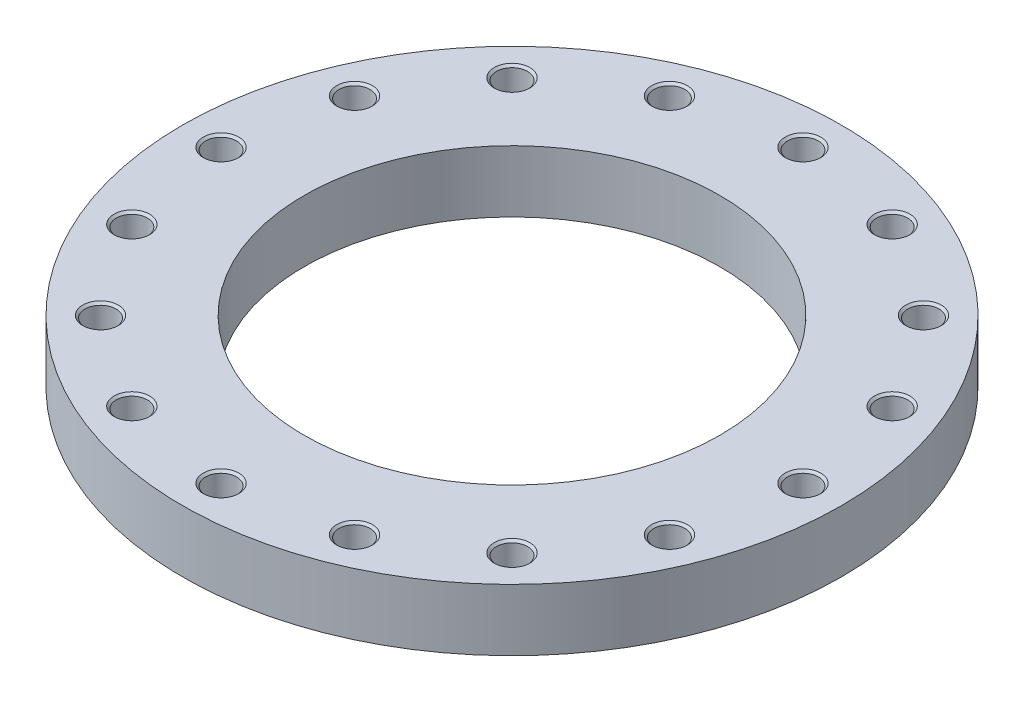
ISO-10303-21;
HEADER;
FILE_DESCRIPTION(('STEP AP214'),'2;1');
FILE_NAME('part.step','',(''),(''),'','','');
FILE_SCHEMA(('AUTOMOTIVE_DESIGN { 1 0 10303 214 1 1 1 1 }'));
ENDSEC;
DATA;
#1=APPLICATION_CONTEXT('core data for automotive mechanical design processes');
#2=APPLICATION_PROTOCOL_DEFINITION('international standard','automotive_design',2000,#1);
#3=PRODUCT_CONTEXT('',#1,'mechanical');
#4=PRODUCT('Part','Part','',(#3));
#5=PRODUCT_RELATED_PRODUCT_CATEGORY('part','',(#4));
#6=PRODUCT_DEFINITION_FORMATION('','',#4);
#7=PRODUCT_DEFINITION_CONTEXT('part definition',#1,'design');
#8=PRODUCT_DEFINITION('design','',#6,#7);
#9=PRODUCT_DEFINITION_SHAPE('','',#8);
#10=(LENGTH_UNIT() NAMED_UNIT(*) SI_UNIT(.MILLI.,.METRE.));
#11=(NAMED_UNIT(*) PLANE_ANGLE_UNIT() SI_UNIT($,.RADIAN.));
#12=(NAMED_UNIT(*) SI_UNIT($,.STERADIAN.) SOLID_ANGLE_UNIT());
#13=UNCERTAINTY_MEASURE_WITH_UNIT(LENGTH_MEASURE(1.E-05),#10,'distance_accuracy_value','');
#14=(GEOMETRIC_REPRESENTATION_CONTEXT(3) GLOBAL_UNCERTAINTY_ASSIGNED_CONTEXT((#13)) GLOBAL_UNIT_ASSIGNED_CONTEXT((#10,
#11,#12)) REPRESENTATION_CONTEXT('',''));
#15=CARTESIAN_POINT('',(0.,0.,0.));
#16=DIRECTION('',(0.,0.,1.));
#17=DIRECTION('',(1.,0.,0.));
#18=AXIS2_PLACEMENT_3D('',#15,#16,#17);
#19=CARTESIAN_POINT('',(0.,26.,0.));
#20=DIRECTION('',(0.,-1.,0.));
#21=DIRECTION('',(1.,0.,0.));
#22=AXIS2_PLACEMENT_3D('',#19,#20,#21);
#23=CYLINDRICAL_SURFACE('',#22,277.5);
#24=CARTESIAN_POINT('',(0.,0.,0.));
#25=DIRECTION('',(0.,1.,0.));
#26=DIRECTION('',(1.,0.,0.));
#27=AXIS2_PLACEMENT_3D('',#24,#25,#26);
#28=CIRCLE('',#27,277.5);
#29=CARTESIAN_POINT('',(277.5,0.,0.));
#30=VERTEX_POINT('',#29);
#31=EDGE_CURVE('E9',#30,#30,#28,.T.);
#32=ORIENTED_EDGE('',*,*,#31,.T.);
#33=EDGE_LOOP('',(#32));
#34=FACE_BOUND('',#33,.T.);
#35=CARTESIAN_POINT('',(0.,52.,0.));
#36=DIRECTION('',(0.,1.,0.));
#37=DIRECTION('',(1.,0.,0.));
#38=AXIS2_PLACEMENT_3D('',#35,#36,#37);
#39=CIRCLE('',#38,277.5);
#40=CARTESIAN_POINT('',(277.5,52.,0.));
#41=VERTEX_POINT('',#40);
#42=EDGE_CURVE('E408',#41,#41,#39,.T.);
#43=ORIENTED_EDGE('',*,*,#42,.F.);
#44=EDGE_LOOP('',(#43));
#45=FACE_BOUND('',#44,.T.);
#46=ADVANCED_FACE('F15',(#34,#45),#23,.T.);
#47=CARTESIAN_POINT('',(226.25,0.,0.));
#48=DIRECTION('',(0.,-1.,0.));
#49=DIRECTION('',(-1.,0.,0.));
#50=AXIS2_PLACEMENT_3D('',#47,#48,#49);
#51=PLANE('',#50);
#52=CARTESIAN_POINT('',(0.,0.,0.));
#53=DIRECTION('',(0.,1.,0.));
#54=DIRECTION('',(1.,0.,0.));
#55=AXIS2_PLACEMENT_3D('',#52,#53,#54);
#56=CIRCLE('',#55,175.);
#57=CARTESIAN_POINT('',(175.,0.,0.));
#58=VERTEX_POINT('',#57);
#59=EDGE_CURVE('E18',#58,#58,#56,.T.);
#60=ORIENTED_EDGE('',*,*,#59,.T.);
#61=EDGE_LOOP('',(#60));
#62=FACE_BOUND('',#61,.T.);
#63=ORIENTED_EDGE('',*,*,#31,.F.);
#64=EDGE_LOOP('',(#63));
#65=FACE_BOUND('',#64,.T.);
#66=ADVANCED_FACE('F443',(#62,#65),#51,.T.);
#67=CARTESIAN_POINT('',(0.,26.,0.));
#68=DIRECTION('',(0.,-1.,0.));
#69=DIRECTION('',(1.,0.,0.));
#70=AXIS2_PLACEMENT_3D('',#67,#68,#69);
#71=CYLINDRICAL_SURFACE('',#70,175.);
#72=CARTESIAN_POINT('',(0.,52.,0.));
#73=DIRECTION('',(0.,1.,0.));
#74=DIRECTION('',(1.,0.,0.));
#75=AXIS2_PLACEMENT_3D('',#72,#73,#74);
#76=CIRCLE('',#75,175.);
#77=CARTESIAN_POINT('',(175.,52.,0.));
#78=VERTEX_POINT('',#77);
#79=EDGE_CURVE('E104',#78,#78,#76,.T.);
#80=ORIENTED_EDGE('',*,*,#79,.T.);
#81=EDGE_LOOP('',(#80));
#82=FACE_BOUND('',#81,.T.);
#83=ORIENTED_EDGE('',*,*,#59,.F.);
#84=EDGE_LOOP('',(#83));
#85=FACE_BOUND('',#84,.T.);
#86=ADVANCED_FACE('F448',(#82,#85),#71,.F.);
#87=CARTESIAN_POINT('',(226.25,52.,0.));
#88=DIRECTION('',(0.,1.,0.));
#89=DIRECTION('',(1.,0.,0.));
#90=AXIS2_PLACEMENT_3D('',#87,#88,#89);
#91=PLANE('',#90);
#92=ORIENTED_EDGE('',*,*,#42,.T.);
#93=EDGE_LOOP('',(#92));
#94=FACE_BOUND('',#93,.T.);
#95=ORIENTED_EDGE('',*,*,#79,.F.);
#96=EDGE_LOOP('',(#95));
#97=FACE_BOUND('',#96,.T.);
#98=CARTESIAN_POINT('',(245.,52.,0.));
#99=DIRECTION('',(0.,-1.,0.));
#100=DIRECTION('',(1.,0.,0.));
#101=AXIS2_PLACEMENT_3D('',#98,#99,#100);
#102=CIRCLE('',#101,15.);
#103=CARTESIAN_POINT('',(260.,52.,0.));
#104=VERTEX_POINT('',#103);
#105=EDGE_CURVE('E432',#104,#104,#102,.T.);
#106=ORIENTED_EDGE('',*,*,#105,.T.);
#107=EDGE_LOOP('',(#106));
#108=FACE_BOUND('',#107,.T.);
#109=CARTESIAN_POINT('',(226.350485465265,52.,-93.757440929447));
#110=DIRECTION('',(0.,-1.,0.));
#111=DIRECTION('',(0.923879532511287,0.,-0.38268343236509));
#112=AXIS2_PLACEMENT_3D('',#109,#110,#111);
#113=CIRCLE('',#112,15.);
#114=CARTESIAN_POINT('',(240.208678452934,52.,-99.4976924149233));
#115=VERTEX_POINT('',#114);
#116=EDGE_CURVE('E426',#115,#115,#113,.T.);
#117=ORIENTED_EDGE('',*,*,#116,.T.);
#118=EDGE_LOOP('',(#117));
#119=FACE_BOUND('',#118,.T.);
#120=CARTESIAN_POINT('',(173.241161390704,52.,-173.241161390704));
#121=DIRECTION('',(0.,-1.,0.));
#122=DIRECTION('',(0.707106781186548,0.,-0.707106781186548));
#123=AXIS2_PLACEMENT_3D('',#120,#121,#122);
#124=CIRCLE('',#123,15.);
#125=CARTESIAN_POINT('',(183.847763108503,52.,-183.847763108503));
#126=VERTEX_POINT('',#125);
#127=EDGE_CURVE('E415',#126,#126,#124,.T.);
#128=ORIENTED_EDGE('',*,*,#127,.T.);
#129=EDGE_LOOP('',(#128));
#130=FACE_BOUND('',#129,.T.);
#131=CARTESIAN_POINT('',(93.757440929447,52.,-226.350485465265));
#132=DIRECTION('',(0.,-1.,0.));
#133=DIRECTION('',(0.38268343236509,0.,-0.923879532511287));
#134=AXIS2_PLACEMENT_3D('',#131,#132,#133);
#135=CIRCLE('',#134,15.);
#136=CARTESIAN_POINT('',(99.4976924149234,52.,-240.208678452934));
#137=VERTEX_POINT('',#136);
#138=EDGE_CURVE('E406',#137,#137,#135,.T.);
#139=ORIENTED_EDGE('',*,*,#138,.T.);
#140=EDGE_LOOP('',(#139));
#141=FACE_BOUND('',#140,.T.);
#142=CARTESIAN_POINT('',(0.,52.,-245.));
#143=DIRECTION('',(0.,-1.,0.));
#144=DIRECTION('',(0.,0.,-1.));
#145=AXIS2_PLACEMENT_3D('',#142,#143,#144);
#146=CIRCLE('',#145,15.);
#147=CARTESIAN_POINT('',(0.,52.,-260.));
#148=VERTEX_POINT('',#147);
#149=EDGE_CURVE('E400',#148,#148,#146,.T.);
#150=ORIENTED_EDGE('',*,*,#149,.T.);
#151=EDGE_LOOP('',(#150));
#152=FACE_BOUND('',#151,.T.);
#153=CARTESIAN_POINT('',(-93.757440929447,52.,-226.350485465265));
#154=DIRECTION('',(0.,-1.,0.));
#155=DIRECTION('',(-0.38268343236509,0.,-0.923879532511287));
#156=AXIS2_PLACEMENT_3D('',#153,#154,#155);
#157=CIRCLE('',#156,15.);
#158=CARTESIAN_POINT('',(-99.4976924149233,52.,-240.208678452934));
#159=VERTEX_POINT('',#158);
#160=EDGE_CURVE('E394',#159,#159,#157,.T.);
#161=ORIENTED_EDGE('',*,*,#160,.T.);
#162=EDGE_LOOP('',(#161));
#163=FACE_BOUND('',#162,.T.);
#164=CARTESIAN_POINT('',(-173.241161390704,52.,-173.241161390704));
#165=DIRECTION('',(0.,-1.,0.));
#166=DIRECTION('',(-0.707106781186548,0.,-0.707106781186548));
#167=AXIS2_PLACEMENT_3D('',#164,#165,#166);
#168=CIRCLE('',#167,15.);
#169=CARTESIAN_POINT('',(-183.847763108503,52.,-183.847763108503));
#170=VERTEX_POINT('',#169);
#171=EDGE_CURVE('E370',#170,#170,#168,.T.);
#172=ORIENTED_EDGE('',*,*,#171,.T.);
#173=EDGE_LOOP('',(#172));
#174=FACE_BOUND('',#173,.T.);
#175=CARTESIAN_POINT('',(-226.350485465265,52.,-93.757440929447));
#176=DIRECTION('',(0.,-1.,0.));
#177=DIRECTION('',(-0.923879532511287,0.,-0.38268343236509));
#178=AXIS2_PLACEMENT_3D('',#175,#176,#177);
#179=CIRCLE('',#178,15.);
#180=CARTESIAN_POINT('',(-240.208678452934,52.,-99.4976924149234));
#181=VERTEX_POINT('',#180);
#182=EDGE_CURVE('E890',#181,#181,#179,.T.);
#183=ORIENTED_EDGE('',*,*,#182,.T.);
#184=EDGE_LOOP('',(#183));
#185=FACE_BOUND('',#184,.T.);
#186=CARTESIAN_POINT('',(-245.,52.,0.));
#187=DIRECTION('',(0.,-1.,0.));
#188=DIRECTION('',(-1.,0.,0.));
#189=AXIS2_PLACEMENT_3D('',#186,#187,#188);
#190=CIRCLE('',#189,15.);
#191=CARTESIAN_POINT('',(-260.,52.,0.));
#192=VERTEX_POINT('',#191);
#193=EDGE_CURVE('E963',#192,#192,#190,.T.);
#194=ORIENTED_EDGE('',*,*,#193,.T.);
#195=EDGE_LOOP('',(#194));
#196=FACE_BOUND('',#195,.T.);
#197=CARTESIAN_POINT('',(-226.350485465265,52.,93.757440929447));
#198=DIRECTION('',(0.,-1.,0.));
#199=DIRECTION('',(-0.923879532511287,0.,0.38268343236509));
#200=AXIS2_PLACEMENT_3D('',#197,#198,#199);
#201=CIRCLE('',#200,15.);
#202=CARTESIAN_POINT('',(-240.208678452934,52.,99.4976924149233));
#203=VERTEX_POINT('',#202);
#204=EDGE_CURVE('E952',#203,#203,#201,.T.);
#205=ORIENTED_EDGE('',*,*,#204,.T.);
#206=EDGE_LOOP('',(#205));
#207=FACE_BOUND('',#206,.T.);
#208=CARTESIAN_POINT('',(-173.241161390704,52.,173.241161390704));
#209=DIRECTION('',(0.,-1.,0.));
#210=DIRECTION('',(-0.707106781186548,0.,0.707106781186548));
#211=AXIS2_PLACEMENT_3D('',#208,#209,#210);
#212=CIRCLE('',#211,15.);
#213=CARTESIAN_POINT('',(-183.847763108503,52.,183.847763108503));
#214=VERTEX_POINT('',#213);
#215=EDGE_CURVE('E865',#214,#214,#212,.T.);
#216=ORIENTED_EDGE('',*,*,#215,.T.);
#217=EDGE_LOOP('',(#216));
#218=FACE_BOUND('',#217,.T.);
#219=CARTESIAN_POINT('',(-93.7574409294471,52.,226.350485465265));
#220=DIRECTION('',(0.,-1.,0.));
#221=DIRECTION('',(-0.382683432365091,0.,0.923879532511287));
#222=AXIS2_PLACEMENT_3D('',#219,#220,#221);
#223=CIRCLE('',#222,15.);
#224=CARTESIAN_POINT('',(-99.4976924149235,52.,240.208678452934));
#225=VERTEX_POINT('',#224);
#226=EDGE_CURVE('E882',#225,#225,#223,.T.);
#227=ORIENTED_EDGE('',*,*,#226,.T.);
#228=EDGE_LOOP('',(#227));
#229=FACE_BOUND('',#228,.T.);
#230=CARTESIAN_POINT('',(0.,52.,245.));
#231=DIRECTION('',(0.,-1.,0.));
#232=DIRECTION('',(0.,0.,1.));
#233=AXIS2_PLACEMENT_3D('',#230,#231,#232);
#234=CIRCLE('',#233,15.);
#235=CARTESIAN_POINT('',(0.,52.,260.));
#236=VERTEX_POINT('',#235);
#237=EDGE_CURVE('E916',#236,#236,#234,.T.);
#238=ORIENTED_EDGE('',*,*,#237,.T.);
#239=EDGE_LOOP('',(#238));
#240=FACE_BOUND('',#239,.T.);
#241=CARTESIAN_POINT('',(93.757440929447,52.,226.350485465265));
#242=DIRECTION('',(0.,-1.,0.));
#243=DIRECTION('',(0.38268343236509,0.,0.923879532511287));
#244=AXIS2_PLACEMENT_3D('',#241,#242,#243);
#245=CIRCLE('',#244,15.);
#246=CARTESIAN_POINT('',(99.4976924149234,52.,240.208678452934));
#247=VERTEX_POINT('',#246);
#248=EDGE_CURVE('E869',#247,#247,#245,.T.);
#249=ORIENTED_EDGE('',*,*,#248,.T.);
#250=EDGE_LOOP('',(#249));
#251=FACE_BOUND('',#250,.T.);
#252=CARTESIAN_POINT('',(173.241161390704,52.,173.241161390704));
#253=DIRECTION('',(0.,-1.,0.));
#254=DIRECTION('',(0.707106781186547,0.,0.707106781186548));
#255=AXIS2_PLACEMENT_3D('',#252,#253,#254);
#256=CIRCLE('',#255,15.);
#257=CARTESIAN_POINT('',(183.847763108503,52.,183.847763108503));
#258=VERTEX_POINT('',#257);
#259=EDGE_CURVE('E851',#258,#258,#256,.T.);
#260=ORIENTED_EDGE('',*,*,#259,.T.);
#261=EDGE_LOOP('',(#260));
#262=FACE_BOUND('',#261,.T.);
#263=CARTESIAN_POINT('',(226.350485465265,52.,93.7574409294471));
#264=DIRECTION('',(0.,-1.,0.));
#265=DIRECTION('',(0.923879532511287,0.,0.382683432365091));
#266=AXIS2_PLACEMENT_3D('',#263,#264,#265);
#267=CIRCLE('',#266,15.);
#268=CARTESIAN_POINT('',(240.208678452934,52.,99.4976924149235));
#269=VERTEX_POINT('',#268);
#270=EDGE_CURVE('E861',#269,#269,#267,.T.);
#271=ORIENTED_EDGE('',*,*,#270,.T.);
#272=EDGE_LOOP('',(#271));
#273=FACE_BOUND('',#272,.T.);
#274=ADVANCED_FACE('F439',(#94,#97,#108,#119,#130,#141,#152,#163,#174,#185,#196,#207,#218,#229,
#240,#251,#262,#273),#91,.T.);
#275=CARTESIAN_POINT('',(245.,8.21673193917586,0.));
#276=DIRECTION('',(0.,1.,0.));
#277=DIRECTION('',(1.,0.,0.));
#278=AXIS2_PLACEMENT_3D('',#275,#276,#277);
#279=CONICAL_SURFACE('',#278,6.5528125,1.0471975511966);
#280=CARTESIAN_POINT('',(245.,12.,0.));
#281=DIRECTION('',(0.,-1.,0.));
#282=DIRECTION('',(1.,0.,0.));
#283=AXIS2_PLACEMENT_3D('',#280,#281,#282);
#284=CIRCLE('',#283,13.105625);
#285=CARTESIAN_POINT('',(258.105625,12.,0.));
#286=VERTEX_POINT('',#285);
#287=EDGE_CURVE('E109',#286,#286,#284,.T.);
#288=ORIENTED_EDGE('',*,*,#287,.F.);
#289=EDGE_LOOP('',(#288));
#290=FACE_BOUND('',#289,.T.);
#291=CARTESIAN_POINT('',(245.,4.43346387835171,0.));
#292=VERTEX_POINT('',#291);
#293=VERTEX_LOOP('',#292);
#294=FACE_BOUND('',#293,.T.);
#295=ADVANCED_FACE('F457',(#290,#294),#279,.F.);
#296=CARTESIAN_POINT('',(245.,16.0528125,0.));
#297=DIRECTION('',(0.,1.,0.));
#298=DIRECTION('',(1.,0.,0.));
#299=AXIS2_PLACEMENT_3D('',#296,#297,#298);
#300=CYLINDRICAL_SURFACE('',#299,13.105625);
#301=CARTESIAN_POINT('',(245.,20.105625,0.));
#302=DIRECTION('',(0.,-1.,0.));
#303=DIRECTION('',(1.,0.,0.));
#304=AXIS2_PLACEMENT_3D('',#301,#302,#303);
#305=CIRCLE('',#304,13.105625);
#306=CARTESIAN_POINT('',(258.105625,20.105625,0.));
#307=VERTEX_POINT('',#306);
#308=EDGE_CURVE('E435',#307,#307,#305,.T.);
#309=ORIENTED_EDGE('',*,*,#308,.F.);
#310=EDGE_LOOP('',(#309));
#311=FACE_BOUND('',#310,.T.);
#312=ORIENTED_EDGE('',*,*,#287,.T.);
#313=EDGE_LOOP('',(#312));
#314=FACE_BOUND('',#313,.T.);
#315=ADVANCED_FACE('F458',(#311,#314),#300,.F.);
#316=CARTESIAN_POINT('',(245.,21.0528125,0.));
#317=DIRECTION('',(0.,1.,0.));
#318=DIRECTION('',(1.,0.,0.));
#319=AXIS2_PLACEMENT_3D('',#316,#317,#318);
#320=CONICAL_SURFACE('',#319,14.0528125,0.785398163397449);
#321=CARTESIAN_POINT('',(245.,22.,0.));
#322=DIRECTION('',(0.,-1.,0.));
#323=DIRECTION('',(1.,0.,0.));
#324=AXIS2_PLACEMENT_3D('',#321,#322,#323);
#325=CIRCLE('',#324,15.);
#326=CARTESIAN_POINT('',(260.,22.,0.));
#327=VERTEX_POINT('',#326);
#328=EDGE_CURVE('E433',#327,#327,#325,.T.);
#329=ORIENTED_EDGE('',*,*,#328,.F.);
#330=EDGE_LOOP('',(#329));
#331=FACE_BOUND('',#330,.T.);
#332=ORIENTED_EDGE('',*,*,#308,.T.);
#333=EDGE_LOOP('',(#332));
#334=FACE_BOUND('',#333,.T.);
#335=ADVANCED_FACE('F461',(#331,#334),#320,.F.);
#336=CARTESIAN_POINT('',(259.0528125,22.,0.));
#337=DIRECTION('',(0.,1.,0.));
#338=DIRECTION('',(-1.,0.,0.));
#339=AXIS2_PLACEMENT_3D('',#336,#337,#338);
#340=PLANE('',#339);
#341=CARTESIAN_POINT('',(245.,22.,0.));
#342=DIRECTION('',(0.,-1.,0.));
#343=DIRECTION('',(1.,0.,0.));
#344=AXIS2_PLACEMENT_3D('',#341,#342,#343);
#345=CIRCLE('',#344,13.105625);
#346=CARTESIAN_POINT('',(258.105625,22.,0.));
#347=VERTEX_POINT('',#346);
#348=EDGE_CURVE('E436',#347,#347,#345,.T.);
#349=ORIENTED_EDGE('',*,*,#348,.F.);
#350=EDGE_LOOP('',(#349));
#351=FACE_BOUND('',#350,.T.);
#352=ORIENTED_EDGE('',*,*,#328,.T.);
#353=EDGE_LOOP('',(#352));
#354=FACE_BOUND('',#353,.T.);
#355=ADVANCED_FACE('F463',(#351,#354),#340,.F.);
#356=CARTESIAN_POINT('',(245.,36.0528125,0.));
#357=DIRECTION('',(0.,1.,0.));
#358=DIRECTION('',(1.,0.,0.));
#359=AXIS2_PLACEMENT_3D('',#356,#357,#358);
#360=CYLINDRICAL_SURFACE('',#359,13.105625);
#361=CARTESIAN_POINT('',(245.,50.105625,0.));
#362=DIRECTION('',(0.,-1.,0.));
#363=DIRECTION('',(1.,0.,0.));
#364=AXIS2_PLACEMENT_3D('',#361,#362,#363);
#365=CIRCLE('',#364,13.105625);
#366=CARTESIAN_POINT('',(258.105625,50.105625,0.));
#367=VERTEX_POINT('',#366);
#368=EDGE_CURVE('E429',#367,#367,#365,.T.);
#369=ORIENTED_EDGE('',*,*,#368,.F.);
#370=EDGE_LOOP('',(#369));
#371=FACE_BOUND('',#370,.T.);
#372=ORIENTED_EDGE('',*,*,#348,.T.);
#373=EDGE_LOOP('',(#372));
#374=FACE_BOUND('',#373,.T.);
#375=ADVANCED_FACE('F466',(#371,#374),#360,.F.);
#376=CARTESIAN_POINT('',(245.,51.0528125,0.));
#377=DIRECTION('',(0.,1.,0.));
#378=DIRECTION('',(1.,0.,0.));
#379=AXIS2_PLACEMENT_3D('',#376,#377,#378);
#380=CONICAL_SURFACE('',#379,14.0528125,0.785398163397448);
#381=ORIENTED_EDGE('',*,*,#105,.F.);
#382=EDGE_LOOP('',(#381));
#383=FACE_BOUND('',#382,.T.);
#384=ORIENTED_EDGE('',*,*,#368,.T.);
#385=EDGE_LOOP('',(#384));
#386=FACE_BOUND('',#385,.T.);
#387=ADVANCED_FACE('F468',(#383,#386),#380,.F.);
#388=CARTESIAN_POINT('',(226.350485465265,8.21673193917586,-93.757440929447));
#389=DIRECTION('',(0.,1.,0.));
#390=DIRECTION('',(0.923879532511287,0.,-0.38268343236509));
#391=AXIS2_PLACEMENT_3D('',#388,#389,#390);
#392=CONICAL_SURFACE('',#391,6.5528125,1.0471975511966);
#393=CARTESIAN_POINT('',(226.350485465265,12.,-93.757440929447));
#394=DIRECTION('',(0.,-1.,0.));
#395=DIRECTION('',(0.923879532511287,0.,-0.38268343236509));
#396=AXIS2_PLACEMENT_3D('',#393,#394,#395);
#397=CIRCLE('',#396,13.105625);
#398=CARTESIAN_POINT('',(238.458504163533,12.,-98.7727464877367));
#399=VERTEX_POINT('',#398);
#400=EDGE_CURVE('E427',#399,#399,#397,.T.);
#401=ORIENTED_EDGE('',*,*,#400,.F.);
#402=EDGE_LOOP('',(#401));
#403=FACE_BOUND('',#402,.T.);
#404=CARTESIAN_POINT('',(226.350485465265,4.43346387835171,-93.757440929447));
#405=VERTEX_POINT('',#404);
#406=VERTEX_LOOP('',#405);
#407=FACE_BOUND('',#406,.T.);
#408=ADVANCED_FACE('F471',(#403,#407),#392,.F.);
#409=CARTESIAN_POINT('',(226.350485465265,16.0528125,-93.757440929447));
#410=DIRECTION('',(0.,1.,0.));
#411=DIRECTION('',(0.923879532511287,0.,-0.38268343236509));
#412=AXIS2_PLACEMENT_3D('',#409,#410,#411);
#413=CYLINDRICAL_SURFACE('',#412,13.105625);
#414=CARTESIAN_POINT('',(226.350485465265,20.105625,-93.757440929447));
#415=DIRECTION('',(0.,-1.,0.));
#416=DIRECTION('',(0.923879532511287,0.,-0.38268343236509));
#417=AXIS2_PLACEMENT_3D('',#414,#415,#416);
#418=CIRCLE('',#417,13.105625);
#419=CARTESIAN_POINT('',(238.458504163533,20.105625,-98.7727464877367));
#420=VERTEX_POINT('',#419);
#421=EDGE_CURVE('E430',#420,#420,#418,.T.);
#422=ORIENTED_EDGE('',*,*,#421,.F.);
#423=EDGE_LOOP('',(#422));
#424=FACE_BOUND('',#423,.T.);
#425=ORIENTED_EDGE('',*,*,#400,.T.);
#426=EDGE_LOOP('',(#425));
#427=FACE_BOUND('',#426,.T.);
#428=ADVANCED_FACE('F473',(#424,#427),#413,.F.);
#429=CARTESIAN_POINT('',(226.350485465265,21.0528125,-93.757440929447));
#430=DIRECTION('',(0.,1.,0.));
#431=DIRECTION('',(0.923879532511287,0.,-0.38268343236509));
#432=AXIS2_PLACEMENT_3D('',#429,#430,#431);
#433=CONICAL_SURFACE('',#432,14.0528125,0.785398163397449);
#434=CARTESIAN_POINT('',(226.350485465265,22.,-93.757440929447));
#435=DIRECTION('',(0.,-1.,0.));
#436=DIRECTION('',(0.923879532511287,0.,-0.38268343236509));
#437=AXIS2_PLACEMENT_3D('',#434,#435,#436);
#438=CIRCLE('',#437,15.);
#439=CARTESIAN_POINT('',(240.208678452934,22.,-99.4976924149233));
#440=VERTEX_POINT('',#439);
#441=EDGE_CURVE('E932',#440,#440,#438,.T.);
#442=ORIENTED_EDGE('',*,*,#441,.F.);
#443=EDGE_LOOP('',(#442));
#444=FACE_BOUND('',#443,.T.);
#445=ORIENTED_EDGE('',*,*,#421,.T.);
#446=EDGE_LOOP('',(#445));
#447=FACE_BOUND('',#446,.T.);
#448=ADVANCED_FACE('F476',(#444,#447),#433,.F.);
#449=CARTESIAN_POINT('',(239.333591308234,22.,-99.13521945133));
#450=DIRECTION('',(0.,1.,0.));
#451=DIRECTION('',(-0.923879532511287,0.,0.38268343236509));
#452=AXIS2_PLACEMENT_3D('',#449,#450,#451);
#453=PLANE('',#452);
#454=CARTESIAN_POINT('',(226.350485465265,22.,-93.757440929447));
#455=DIRECTION('',(0.,-1.,0.));
#456=DIRECTION('',(0.923879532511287,0.,-0.38268343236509));
#457=AXIS2_PLACEMENT_3D('',#454,#455,#456);
#458=CIRCLE('',#457,13.105625);
#459=CARTESIAN_POINT('',(238.458504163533,22.,-98.7727464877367));
#460=VERTEX_POINT('',#459);
#461=EDGE_CURVE('E376',#460,#460,#458,.T.);
#462=ORIENTED_EDGE('',*,*,#461,.F.);
#463=EDGE_LOOP('',(#462));
#464=FACE_BOUND('',#463,.T.);
#465=ORIENTED_EDGE('',*,*,#441,.T.);
#466=EDGE_LOOP('',(#465));
#467=FACE_BOUND('',#466,.T.);
#468=ADVANCED_FACE('F480',(#464,#467),#453,.F.);
#469=CARTESIAN_POINT('',(226.350485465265,36.0528125,-93.757440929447));
#470=DIRECTION('',(0.,1.,0.));
#471=DIRECTION('',(0.923879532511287,0.,-0.38268343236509));
#472=AXIS2_PLACEMENT_3D('',#469,#470,#471);
#473=CYLINDRICAL_SURFACE('',#472,13.105625);
#474=CARTESIAN_POINT('',(226.350485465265,50.105625,-93.757440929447));
#475=DIRECTION('',(0.,-1.,0.));
#476=DIRECTION('',(0.923879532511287,0.,-0.38268343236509));
#477=AXIS2_PLACEMENT_3D('',#474,#475,#476);
#478=CIRCLE('',#477,13.105625);
#479=CARTESIAN_POINT('',(238.458504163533,50.105625,-98.7727464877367));
#480=VERTEX_POINT('',#479);
#481=EDGE_CURVE('E424',#480,#480,#478,.T.);
#482=ORIENTED_EDGE('',*,*,#481,.F.);
#483=EDGE_LOOP('',(#482));
#484=FACE_BOUND('',#483,.T.);
#485=ORIENTED_EDGE('',*,*,#461,.T.);
#486=EDGE_LOOP('',(#485));
#487=FACE_BOUND('',#486,.T.);
#488=ADVANCED_FACE('F482',(#484,#487),#473,.F.);
#489=CARTESIAN_POINT('',(226.350485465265,51.0528125,-93.757440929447));
#490=DIRECTION('',(0.,1.,0.));
#491=DIRECTION('',(0.923879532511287,0.,-0.38268343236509));
#492=AXIS2_PLACEMENT_3D('',#489,#490,#491);
#493=CONICAL_SURFACE('',#492,14.0528125,0.785398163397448);
#494=ORIENTED_EDGE('',*,*,#116,.F.);
#495=EDGE_LOOP('',(#494));
#496=FACE_BOUND('',#495,.T.);
#497=ORIENTED_EDGE('',*,*,#481,.T.);
#498=EDGE_LOOP('',(#497));
#499=FACE_BOUND('',#498,.T.);
#500=ADVANCED_FACE('F485',(#496,#499),#493,.F.);
#501=CARTESIAN_POINT('',(173.241161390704,8.21673193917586,-173.241161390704));
#502=DIRECTION('',(0.,1.,0.));
#503=DIRECTION('',(0.707106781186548,0.,-0.707106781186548));
#504=AXIS2_PLACEMENT_3D('',#501,#502,#503);
#505=CONICAL_SURFACE('',#504,6.5528125,1.0471975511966);
#506=CARTESIAN_POINT('',(173.241161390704,12.,-173.241161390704));
#507=DIRECTION('',(0.,-1.,0.));
#508=DIRECTION('',(0.707106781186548,0.,-0.707106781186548));
#509=AXIS2_PLACEMENT_3D('',#506,#507,#508);
#510=CIRCLE('',#509,13.105625);
#511=CARTESIAN_POINT('',(182.508237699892,12.,-182.508237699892));
#512=VERTEX_POINT('',#511);
#513=EDGE_CURVE('E421',#512,#512,#510,.T.);
#514=ORIENTED_EDGE('',*,*,#513,.F.);
#515=EDGE_LOOP('',(#514));
#516=FACE_BOUND('',#515,.T.);
#517=CARTESIAN_POINT('',(173.241161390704,4.43346387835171,-173.241161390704));
#518=VERTEX_POINT('',#517);
#519=VERTEX_LOOP('',#518);
#520=FACE_BOUND('',#519,.T.);
#521=ADVANCED_FACE('F491',(#516,#520),#505,.F.);
#522=CARTESIAN_POINT('',(173.241161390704,16.0528125,-173.241161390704));
#523=DIRECTION('',(0.,1.,0.));
#524=DIRECTION('',(0.707106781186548,0.,-0.707106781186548));
#525=AXIS2_PLACEMENT_3D('',#522,#523,#524);
#526=CYLINDRICAL_SURFACE('',#525,13.105625);
#527=CARTESIAN_POINT('',(173.241161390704,20.105625,-173.241161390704));
#528=DIRECTION('',(0.,-1.,0.));
#529=DIRECTION('',(0.707106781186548,0.,-0.707106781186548));
#530=AXIS2_PLACEMENT_3D('',#527,#528,#529);
#531=CIRCLE('',#530,13.105625);
#532=CARTESIAN_POINT('',(182.508237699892,20.105625,-182.508237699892));
#533=VERTEX_POINT('',#532);
#534=EDGE_CURVE('E419',#533,#533,#531,.T.);
#535=ORIENTED_EDGE('',*,*,#534,.F.);
#536=EDGE_LOOP('',(#535));
#537=FACE_BOUND('',#536,.T.);
#538=ORIENTED_EDGE('',*,*,#513,.T.);
#539=EDGE_LOOP('',(#538));
#540=FACE_BOUND('',#539,.T.);
#541=ADVANCED_FACE('F496',(#537,#540),#526,.F.);
#542=CARTESIAN_POINT('',(173.241161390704,21.0528125,-173.241161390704));
#543=DIRECTION('',(0.,1.,0.));
#544=DIRECTION('',(0.707106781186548,0.,-0.707106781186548));
#545=AXIS2_PLACEMENT_3D('',#542,#543,#544);
#546=CONICAL_SURFACE('',#545,14.0528125,0.785398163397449);
#547=CARTESIAN_POINT('',(173.241161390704,22.,-173.241161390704));
#548=DIRECTION('',(0.,-1.,0.));
#549=DIRECTION('',(0.707106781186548,0.,-0.707106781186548));
#550=AXIS2_PLACEMENT_3D('',#547,#548,#549);
#551=CIRCLE('',#550,15.);
#552=CARTESIAN_POINT('',(183.847763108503,22.,-183.847763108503));
#553=VERTEX_POINT('',#552);
#554=EDGE_CURVE('E422',#553,#553,#551,.T.);
#555=ORIENTED_EDGE('',*,*,#554,.F.);
#556=EDGE_LOOP('',(#555));
#557=FACE_BOUND('',#556,.T.);
#558=ORIENTED_EDGE('',*,*,#534,.T.);
#559=EDGE_LOOP('',(#558));
#560=FACE_BOUND('',#559,.T.);
#561=ADVANCED_FACE('F498',(#557,#560),#546,.F.);
#562=CARTESIAN_POINT('',(183.178000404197,22.,-183.178000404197));
#563=DIRECTION('',(0.,1.,0.));
#564=DIRECTION('',(-0.707106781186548,0.,0.707106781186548));
#565=AXIS2_PLACEMENT_3D('',#562,#563,#564);
#566=PLANE('',#565);
#567=CARTESIAN_POINT('',(173.241161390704,22.,-173.241161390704));
#568=DIRECTION('',(0.,-1.,0.));
#569=DIRECTION('',(0.707106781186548,0.,-0.707106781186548));
#570=AXIS2_PLACEMENT_3D('',#567,#568,#569);
#571=CIRCLE('',#570,13.105625);
#572=CARTESIAN_POINT('',(182.508237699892,22.,-182.508237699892));
#573=VERTEX_POINT('',#572);
#574=EDGE_CURVE('E417',#573,#573,#571,.T.);
#575=ORIENTED_EDGE('',*,*,#574,.F.);
#576=EDGE_LOOP('',(#575));
#577=FACE_BOUND('',#576,.T.);
#578=ORIENTED_EDGE('',*,*,#554,.T.);
#579=EDGE_LOOP('',(#578));
#580=FACE_BOUND('',#579,.T.);
#581=ADVANCED_FACE('F501',(#577,#580),#566,.F.);
#582=CARTESIAN_POINT('',(173.241161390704,36.0528125,-173.241161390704));
#583=DIRECTION('',(0.,1.,0.));
#584=DIRECTION('',(0.707106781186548,0.,-0.707106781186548));
#585=AXIS2_PLACEMENT_3D('',#582,#583,#584);
#586=CYLINDRICAL_SURFACE('',#585,13.105625);
#587=CARTESIAN_POINT('',(173.241161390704,50.105625,-173.241161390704));
#588=DIRECTION('',(0.,-1.,0.));
#589=DIRECTION('',(0.707106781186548,0.,-0.707106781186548));
#590=AXIS2_PLACEMENT_3D('',#587,#588,#589);
#591=CIRCLE('',#590,13.105625);
#592=CARTESIAN_POINT('',(182.508237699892,50.105625,-182.508237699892));
#593=VERTEX_POINT('',#592);
#594=EDGE_CURVE('E418',#593,#593,#591,.T.);
#595=ORIENTED_EDGE('',*,*,#594,.F.);
#596=EDGE_LOOP('',(#595));
#597=FACE_BOUND('',#596,.T.);
#598=ORIENTED_EDGE('',*,*,#574,.T.);
#599=EDGE_LOOP('',(#598));
#600=FACE_BOUND('',#599,.T.);
#601=ADVANCED_FACE('F503',(#597,#600),#586,.F.);
#602=CARTESIAN_POINT('',(173.241161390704,51.0528125,-173.241161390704));
#603=DIRECTION('',(0.,1.,0.));
#604=DIRECTION('',(0.707106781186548,0.,-0.707106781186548));
#605=AXIS2_PLACEMENT_3D('',#602,#603,#604);
#606=CONICAL_SURFACE('',#605,14.0528125,0.785398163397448);
#607=ORIENTED_EDGE('',*,*,#127,.F.);
#608=EDGE_LOOP('',(#607));
#609=FACE_BOUND('',#608,.T.);
#610=ORIENTED_EDGE('',*,*,#594,.T.);
#611=EDGE_LOOP('',(#610));
#612=FACE_BOUND('',#611,.T.);
#613=ADVANCED_FACE('F506',(#609,#612),#606,.F.);
#614=CARTESIAN_POINT('',(93.757440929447,8.21673193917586,-226.350485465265));
#615=DIRECTION('',(0.,1.,0.));
#616=DIRECTION('',(0.38268343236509,0.,-0.923879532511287));
#617=AXIS2_PLACEMENT_3D('',#614,#615,#616);
#618=CONICAL_SURFACE('',#617,6.5528125,1.0471975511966);
#619=CARTESIAN_POINT('',(93.757440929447,12.,-226.350485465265));
#620=DIRECTION('',(0.,-1.,0.));
#621=DIRECTION('',(0.38268343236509,0.,-0.923879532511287));
#622=AXIS2_PLACEMENT_3D('',#619,#620,#621);
#623=CIRCLE('',#622,13.105625);
#624=CARTESIAN_POINT('',(98.7727464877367,12.,-238.458504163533));
#625=VERTEX_POINT('',#624);
#626=EDGE_CURVE('E414',#625,#625,#623,.T.);
#627=ORIENTED_EDGE('',*,*,#626,.F.);
#628=EDGE_LOOP('',(#627));
#629=FACE_BOUND('',#628,.T.);
#630=CARTESIAN_POINT('',(93.757440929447,4.43346387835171,-226.350485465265));
#631=VERTEX_POINT('',#630);
#632=VERTEX_LOOP('',#631);
#633=FACE_BOUND('',#632,.T.);
#634=ADVANCED_FACE('F510',(#629,#633),#618,.F.);
#635=CARTESIAN_POINT('',(93.757440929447,16.0528125,-226.350485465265));
#636=DIRECTION('',(0.,1.,0.));
#637=DIRECTION('',(0.38268343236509,0.,-0.923879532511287));
#638=AXIS2_PLACEMENT_3D('',#635,#636,#637);
#639=CYLINDRICAL_SURFACE('',#638,13.105625);
#640=CARTESIAN_POINT('',(93.757440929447,20.105625,-226.350485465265));
#641=DIRECTION('',(0.,-1.,0.));
#642=DIRECTION('',(0.38268343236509,0.,-0.923879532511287));
#643=AXIS2_PLACEMENT_3D('',#640,#641,#642);
#644=CIRCLE('',#643,13.105625);
#645=CARTESIAN_POINT('',(98.7727464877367,20.105625,-238.458504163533));
#646=VERTEX_POINT('',#645);
#647=EDGE_CURVE('E412',#646,#646,#644,.T.);
#648=ORIENTED_EDGE('',*,*,#647,.F.);
#649=EDGE_LOOP('',(#648));
#650=FACE_BOUND('',#649,.T.);
#651=ORIENTED_EDGE('',*,*,#626,.T.);
#652=EDGE_LOOP('',(#651));
#653=FACE_BOUND('',#652,.T.);
#654=ADVANCED_FACE('F514',(#650,#653),#639,.F.);
#655=CARTESIAN_POINT('',(93.757440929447,21.0528125,-226.350485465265));
#656=DIRECTION('',(0.,1.,0.));
#657=DIRECTION('',(0.38268343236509,0.,-0.923879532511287));
#658=AXIS2_PLACEMENT_3D('',#655,#656,#657);
#659=CONICAL_SURFACE('',#658,14.0528125,0.785398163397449);
#660=CARTESIAN_POINT('',(93.757440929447,22.,-226.350485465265));
#661=DIRECTION('',(0.,-1.,0.));
#662=DIRECTION('',(0.38268343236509,0.,-0.923879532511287));
#663=AXIS2_PLACEMENT_3D('',#660,#661,#662);
#664=CIRCLE('',#663,15.);
#665=CARTESIAN_POINT('',(99.4976924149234,22.,-240.208678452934));
#666=VERTEX_POINT('',#665);
#667=EDGE_CURVE('E411',#666,#666,#664,.T.);
#668=ORIENTED_EDGE('',*,*,#667,.F.);
#669=EDGE_LOOP('',(#668));
#670=FACE_BOUND('',#669,.T.);
#671=ORIENTED_EDGE('',*,*,#647,.T.);
#672=EDGE_LOOP('',(#671));
#673=FACE_BOUND('',#672,.T.);
#674=ADVANCED_FACE('F518',(#670,#673),#659,.F.);
#675=CARTESIAN_POINT('',(99.1352194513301,22.,-239.333591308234));
#676=DIRECTION('',(0.,1.,0.));
#677=DIRECTION('',(-0.38268343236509,0.,0.923879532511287));
#678=AXIS2_PLACEMENT_3D('',#675,#676,#677);
#679=PLANE('',#678);
#680=CARTESIAN_POINT('',(93.757440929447,22.,-226.350485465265));
#681=DIRECTION('',(0.,-1.,0.));
#682=DIRECTION('',(0.38268343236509,0.,-0.923879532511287));
#683=AXIS2_PLACEMENT_3D('',#680,#681,#682);
#684=CIRCLE('',#683,13.105625);
#685=CARTESIAN_POINT('',(98.7727464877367,22.,-238.458504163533));
#686=VERTEX_POINT('',#685);
#687=EDGE_CURVE('E409',#686,#686,#684,.T.);
#688=ORIENTED_EDGE('',*,*,#687,.F.);
#689=EDGE_LOOP('',(#688));
#690=FACE_BOUND('',#689,.T.);
#691=ORIENTED_EDGE('',*,*,#667,.T.);
#692=EDGE_LOOP('',(#691));
#693=FACE_BOUND('',#692,.T.);
#694=ADVANCED_FACE('F736',(#690,#693),#679,.F.);
#695=CARTESIAN_POINT('',(93.757440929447,36.0528125,-226.350485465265));
#696=DIRECTION('',(0.,1.,0.));
#697=DIRECTION('',(0.38268343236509,0.,-0.923879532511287));
#698=AXIS2_PLACEMENT_3D('',#695,#696,#697);
#699=CYLINDRICAL_SURFACE('',#698,13.105625);
#700=CARTESIAN_POINT('',(93.757440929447,50.105625,-226.350485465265));
#701=DIRECTION('',(0.,-1.,0.));
#702=DIRECTION('',(0.38268343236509,0.,-0.923879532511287));
#703=AXIS2_PLACEMENT_3D('',#700,#701,#702);
#704=CIRCLE('',#703,13.105625);
#705=CARTESIAN_POINT('',(98.7727464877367,50.105625,-238.458504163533));
#706=VERTEX_POINT('',#705);
#707=EDGE_CURVE('E404',#706,#706,#704,.T.);
#708=ORIENTED_EDGE('',*,*,#707,.F.);
#709=EDGE_LOOP('',(#708));
#710=FACE_BOUND('',#709,.T.);
#711=ORIENTED_EDGE('',*,*,#687,.T.);
#712=EDGE_LOOP('',(#711));
#713=FACE_BOUND('',#712,.T.);
#714=ADVANCED_FACE('F524',(#710,#713),#699,.F.);
#715=CARTESIAN_POINT('',(93.757440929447,51.0528125,-226.350485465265));
#716=DIRECTION('',(0.,1.,0.));
#717=DIRECTION('',(0.38268343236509,0.,-0.923879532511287));
#718=AXIS2_PLACEMENT_3D('',#715,#716,#717);
#719=CONICAL_SURFACE('',#718,14.0528125,0.785398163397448);
#720=ORIENTED_EDGE('',*,*,#138,.F.);
#721=EDGE_LOOP('',(#720));
#722=FACE_BOUND('',#721,.T.);
#723=ORIENTED_EDGE('',*,*,#707,.T.);
#724=EDGE_LOOP('',(#723));
#725=FACE_BOUND('',#724,.T.);
#726=ADVANCED_FACE('F520',(#722,#725),#719,.F.);
#727=CARTESIAN_POINT('',(0.,8.21673193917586,-245.));
#728=DIRECTION('',(0.,1.,0.));
#729=DIRECTION('',(0.,0.,-1.));
#730=AXIS2_PLACEMENT_3D('',#727,#728,#729);
#731=CONICAL_SURFACE('',#730,6.5528125,1.0471975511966);
#732=CARTESIAN_POINT('',(0.,12.,-245.));
#733=DIRECTION('',(0.,-1.,0.));
#734=DIRECTION('',(0.,0.,-1.));
#735=AXIS2_PLACEMENT_3D('',#732,#733,#734);
#736=CIRCLE('',#735,13.105625);
#737=CARTESIAN_POINT('',(0.,12.,-258.105625));
#738=VERTEX_POINT('',#737);
#739=EDGE_CURVE('E379',#738,#738,#736,.T.);
#740=ORIENTED_EDGE('',*,*,#739,.F.);
#741=EDGE_LOOP('',(#740));
#742=FACE_BOUND('',#741,.T.);
#743=CARTESIAN_POINT('',(0.,4.43346387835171,-245.));
#744=VERTEX_POINT('',#743);
#745=VERTEX_LOOP('',#744);
#746=FACE_BOUND('',#745,.T.);
#747=ADVANCED_FACE('F523',(#742,#746),#731,.F.);
#748=CARTESIAN_POINT('',(0.,16.0528125,-245.));
#749=DIRECTION('',(0.,1.,0.));
#750=DIRECTION('',(0.,0.,-1.));
#751=AXIS2_PLACEMENT_3D('',#748,#749,#750);
#752=CYLINDRICAL_SURFACE('',#751,13.105625);
#753=CARTESIAN_POINT('',(0.,20.105625,-245.));
#754=DIRECTION('',(0.,-1.,0.));
#755=DIRECTION('',(0.,0.,-1.));
#756=AXIS2_PLACEMENT_3D('',#753,#754,#755);
#757=CIRCLE('',#756,13.105625);
#758=CARTESIAN_POINT('',(0.,20.105625,-258.105625));
#759=VERTEX_POINT('',#758);
#760=EDGE_CURVE('E377',#759,#759,#757,.T.);
#761=ORIENTED_EDGE('',*,*,#760,.F.);
#762=EDGE_LOOP('',(#761));
#763=FACE_BOUND('',#762,.T.);
#764=ORIENTED_EDGE('',*,*,#739,.T.);
#765=EDGE_LOOP('',(#764));
#766=FACE_BOUND('',#765,.T.);
#767=ADVANCED_FACE('F528',(#763,#766),#752,.F.);
#768=CARTESIAN_POINT('',(0.,21.0528125,-245.));
#769=DIRECTION('',(0.,1.,0.));
#770=DIRECTION('',(0.,0.,-1.));
#771=AXIS2_PLACEMENT_3D('',#768,#769,#770);
#772=CONICAL_SURFACE('',#771,14.0528125,0.785398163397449);
#773=CARTESIAN_POINT('',(0.,22.,-245.));
#774=DIRECTION('',(0.,-1.,0.));
#775=DIRECTION('',(0.,0.,-1.));
#776=AXIS2_PLACEMENT_3D('',#773,#774,#775);
#777=CIRCLE('',#776,15.);
#778=CARTESIAN_POINT('',(0.,22.,-260.));
#779=VERTEX_POINT('',#778);
#780=EDGE_CURVE('E380',#779,#779,#777,.T.);
#781=ORIENTED_EDGE('',*,*,#780,.F.);
#782=EDGE_LOOP('',(#781));
#783=FACE_BOUND('',#782,.T.);
#784=ORIENTED_EDGE('',*,*,#760,.T.);
#785=EDGE_LOOP('',(#784));
#786=FACE_BOUND('',#785,.T.);
#787=ADVANCED_FACE('F530',(#783,#786),#772,.F.);
#788=CARTESIAN_POINT('',(0.,22.,-259.0528125));
#789=DIRECTION('',(0.,1.,0.));
#790=DIRECTION('',(0.,0.,1.));
#791=AXIS2_PLACEMENT_3D('',#788,#789,#790);
#792=PLANE('',#791);
#793=CARTESIAN_POINT('',(0.,22.,-245.));
#794=DIRECTION('',(0.,-1.,0.));
#795=DIRECTION('',(0.,0.,-1.));
#796=AXIS2_PLACEMENT_3D('',#793,#794,#795);
#797=CIRCLE('',#796,13.105625);
#798=CARTESIAN_POINT('',(0.,22.,-258.105625));
#799=VERTEX_POINT('',#798);
#800=EDGE_CURVE('E401',#799,#799,#797,.T.);
#801=ORIENTED_EDGE('',*,*,#800,.F.);
#802=EDGE_LOOP('',(#801));
#803=FACE_BOUND('',#802,.T.);
#804=ORIENTED_EDGE('',*,*,#780,.T.);
#805=EDGE_LOOP('',(#804));
#806=FACE_BOUND('',#805,.T.);
#807=ADVANCED_FACE('F533',(#803,#806),#792,.F.);
#808=CARTESIAN_POINT('',(0.,36.0528125,-245.));
#809=DIRECTION('',(0.,1.,0.));
#810=DIRECTION('',(0.,0.,-1.));
#811=AXIS2_PLACEMENT_3D('',#808,#809,#810);
#812=CYLINDRICAL_SURFACE('',#811,13.105625);
#813=CARTESIAN_POINT('',(0.,50.105625,-245.));
#814=DIRECTION('',(0.,-1.,0.));
#815=DIRECTION('',(0.,0.,-1.));
#816=AXIS2_PLACEMENT_3D('',#813,#814,#815);
#817=CIRCLE('',#816,13.105625);
#818=CARTESIAN_POINT('',(0.,50.105625,-258.105625));
#819=VERTEX_POINT('',#818);
#820=EDGE_CURVE('E398',#819,#819,#817,.T.);
#821=ORIENTED_EDGE('',*,*,#820,.F.);
#822=EDGE_LOOP('',(#821));
#823=FACE_BOUND('',#822,.T.);
#824=ORIENTED_EDGE('',*,*,#800,.T.);
#825=EDGE_LOOP('',(#824));
#826=FACE_BOUND('',#825,.T.);
#827=ADVANCED_FACE('F535',(#823,#826),#812,.F.);
#828=CARTESIAN_POINT('',(0.,51.0528125,-245.));
#829=DIRECTION('',(0.,1.,0.));
#830=DIRECTION('',(0.,0.,-1.));
#831=AXIS2_PLACEMENT_3D('',#828,#829,#830);
#832=CONICAL_SURFACE('',#831,14.0528125,0.785398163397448);
#833=ORIENTED_EDGE('',*,*,#149,.F.);
#834=EDGE_LOOP('',(#833));
#835=FACE_BOUND('',#834,.T.);
#836=ORIENTED_EDGE('',*,*,#820,.T.);
#837=EDGE_LOOP('',(#836));
#838=FACE_BOUND('',#837,.T.);
#839=ADVANCED_FACE('F538',(#835,#838),#832,.F.);
#840=CARTESIAN_POINT('',(-93.757440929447,8.21673193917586,-226.350485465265));
#841=DIRECTION('',(0.,1.,0.));
#842=DIRECTION('',(-0.38268343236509,0.,-0.923879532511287));
#843=AXIS2_PLACEMENT_3D('',#840,#841,#842);
#844=CONICAL_SURFACE('',#843,6.5528125,1.0471975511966);
#845=CARTESIAN_POINT('',(-93.757440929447,12.,-226.350485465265));
#846=DIRECTION('',(0.,-1.,0.));
#847=DIRECTION('',(-0.38268343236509,0.,-0.923879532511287));
#848=AXIS2_PLACEMENT_3D('',#845,#846,#847);
#849=CIRCLE('',#848,13.105625);
#850=CARTESIAN_POINT('',(-98.7727464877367,12.,-238.458504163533));
#851=VERTEX_POINT('',#850);
#852=EDGE_CURVE('E396',#851,#851,#849,.T.);
#853=ORIENTED_EDGE('',*,*,#852,.F.);
#854=EDGE_LOOP('',(#853));
#855=FACE_BOUND('',#854,.T.);
#856=CARTESIAN_POINT('',(-93.757440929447,4.43346387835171,-226.350485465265));
#857=VERTEX_POINT('',#856);
#858=VERTEX_LOOP('',#857);
#859=FACE_BOUND('',#858,.T.);
#860=ADVANCED_FACE('F540',(#855,#859),#844,.F.);
#861=CARTESIAN_POINT('',(-93.757440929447,16.0528125,-226.350485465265));
#862=DIRECTION('',(0.,1.,0.));
#863=DIRECTION('',(-0.38268343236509,0.,-0.923879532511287));
#864=AXIS2_PLACEMENT_3D('',#861,#862,#863);
#865=CYLINDRICAL_SURFACE('',#864,13.105625);
#866=CARTESIAN_POINT('',(-93.757440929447,20.105625,-226.350485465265));
#867=DIRECTION('',(0.,-1.,0.));
#868=DIRECTION('',(-0.38268343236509,0.,-0.923879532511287));
#869=AXIS2_PLACEMENT_3D('',#866,#867,#868);
#870=CIRCLE('',#869,13.105625);
#871=CARTESIAN_POINT('',(-98.7727464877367,20.105625,-238.458504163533));
#872=VERTEX_POINT('',#871);
#873=EDGE_CURVE('E147',#872,#872,#870,.T.);
#874=ORIENTED_EDGE('',*,*,#873,.F.);
#875=EDGE_LOOP('',(#874));
#876=FACE_BOUND('',#875,.T.);
#877=ORIENTED_EDGE('',*,*,#852,.T.);
#878=EDGE_LOOP('',(#877));
#879=FACE_BOUND('',#878,.T.);
#880=ADVANCED_FACE('F543',(#876,#879),#865,.F.);
#881=CARTESIAN_POINT('',(-93.757440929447,21.0528125,-226.350485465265));
#882=DIRECTION('',(0.,1.,0.));
#883=DIRECTION('',(-0.38268343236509,0.,-0.923879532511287));
#884=AXIS2_PLACEMENT_3D('',#881,#882,#883);
#885=CONICAL_SURFACE('',#884,14.0528125,0.785398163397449);
#886=CARTESIAN_POINT('',(-93.757440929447,22.,-226.350485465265));
#887=DIRECTION('',(0.,-1.,0.));
#888=DIRECTION('',(-0.38268343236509,0.,-0.923879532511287));
#889=AXIS2_PLACEMENT_3D('',#886,#887,#888);
#890=CIRCLE('',#889,15.);
#891=CARTESIAN_POINT('',(-99.4976924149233,22.,-240.208678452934));
#892=VERTEX_POINT('',#891);
#893=EDGE_CURVE('E154',#892,#892,#890,.T.);
#894=ORIENTED_EDGE('',*,*,#893,.F.);
#895=EDGE_LOOP('',(#894));
#896=FACE_BOUND('',#895,.T.);
#897=ORIENTED_EDGE('',*,*,#873,.T.);
#898=EDGE_LOOP('',(#897));
#899=FACE_BOUND('',#898,.T.);
#900=ADVANCED_FACE('F547',(#896,#899),#885,.F.);
#901=CARTESIAN_POINT('',(-99.13521945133,22.,-239.333591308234));
#902=DIRECTION('',(0.,1.,0.));
#903=DIRECTION('',(0.38268343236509,0.,0.923879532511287));
#904=AXIS2_PLACEMENT_3D('',#901,#902,#903);
#905=PLANE('',#904);
#906=CARTESIAN_POINT('',(-93.757440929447,22.,-226.350485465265));
#907=DIRECTION('',(0.,-1.,0.));
#908=DIRECTION('',(-0.38268343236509,0.,-0.923879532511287));
#909=AXIS2_PLACEMENT_3D('',#906,#907,#908);
#910=CIRCLE('',#909,13.105625);
#911=CARTESIAN_POINT('',(-98.7727464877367,22.,-238.458504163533));
#912=VERTEX_POINT('',#911);
#913=EDGE_CURVE('E392',#912,#912,#910,.T.);
#914=ORIENTED_EDGE('',*,*,#913,.F.);
#915=EDGE_LOOP('',(#914));
#916=FACE_BOUND('',#915,.T.);
#917=ORIENTED_EDGE('',*,*,#893,.T.);
#918=EDGE_LOOP('',(#917));
#919=FACE_BOUND('',#918,.T.);
#920=ADVANCED_FACE('F551',(#916,#919),#905,.F.);
#921=CARTESIAN_POINT('',(-93.757440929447,36.0528125,-226.350485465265));
#922=DIRECTION('',(0.,1.,0.));
#923=DIRECTION('',(-0.38268343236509,0.,-0.923879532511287));
#924=AXIS2_PLACEMENT_3D('',#921,#922,#923);
#925=CYLINDRICAL_SURFACE('',#924,13.105625);
#926=CARTESIAN_POINT('',(-93.757440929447,50.105625,-226.350485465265));
#927=DIRECTION('',(0.,-1.,0.));
#928=DIRECTION('',(-0.38268343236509,0.,-0.923879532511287));
#929=AXIS2_PLACEMENT_3D('',#926,#927,#928);
#930=CIRCLE('',#929,13.105625);
#931=CARTESIAN_POINT('',(-98.7727464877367,50.105625,-238.458504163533));
#932=VERTEX_POINT('',#931);
#933=EDGE_CURVE('E391',#932,#932,#930,.T.);
#934=ORIENTED_EDGE('',*,*,#933,.F.);
#935=EDGE_LOOP('',(#934));
#936=FACE_BOUND('',#935,.T.);
#937=ORIENTED_EDGE('',*,*,#913,.T.);
#938=EDGE_LOOP('',(#937));
#939=FACE_BOUND('',#938,.T.);
#940=ADVANCED_FACE('F557',(#936,#939),#925,.F.);
#941=CARTESIAN_POINT('',(-93.757440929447,51.0528125,-226.350485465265));
#942=DIRECTION('',(0.,1.,0.));
#943=DIRECTION('',(-0.38268343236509,0.,-0.923879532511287));
#944=AXIS2_PLACEMENT_3D('',#941,#942,#943);
#945=CONICAL_SURFACE('',#944,14.0528125,0.785398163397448);
#946=ORIENTED_EDGE('',*,*,#160,.F.);
#947=EDGE_LOOP('',(#946));
#948=FACE_BOUND('',#947,.T.);
#949=ORIENTED_EDGE('',*,*,#933,.T.);
#950=EDGE_LOOP('',(#949));
#951=FACE_BOUND('',#950,.T.);
#952=ADVANCED_FACE('F553',(#948,#951),#945,.F.);
#953=CARTESIAN_POINT('',(-173.241161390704,8.21673193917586,-173.241161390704));
#954=DIRECTION('',(0.,1.,0.));
#955=DIRECTION('',(-0.707106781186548,0.,-0.707106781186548));
#956=AXIS2_PLACEMENT_3D('',#953,#954,#955);
#957=CONICAL_SURFACE('',#956,6.5528125,1.0471975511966);
#958=CARTESIAN_POINT('',(-173.241161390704,12.,-173.241161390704));
#959=DIRECTION('',(0.,-1.,0.));
#960=DIRECTION('',(-0.707106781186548,0.,-0.707106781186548));
#961=AXIS2_PLACEMENT_3D('',#958,#959,#960);
#962=CIRCLE('',#961,13.105625);
#963=CARTESIAN_POINT('',(-182.508237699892,12.,-182.508237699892));
#964=VERTEX_POINT('',#963);
#965=EDGE_CURVE('E389',#964,#964,#962,.T.);
#966=ORIENTED_EDGE('',*,*,#965,.F.);
#967=EDGE_LOOP('',(#966));
#968=FACE_BOUND('',#967,.T.);
#969=CARTESIAN_POINT('',(-173.241161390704,4.43346387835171,-173.241161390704));
#970=VERTEX_POINT('',#969);
#971=VERTEX_LOOP('',#970);
#972=FACE_BOUND('',#971,.T.);
#973=ADVANCED_FACE('F556',(#968,#972),#957,.F.);
#974=CARTESIAN_POINT('',(-173.241161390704,16.0528125,-173.241161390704));
#975=DIRECTION('',(0.,1.,0.));
#976=DIRECTION('',(-0.707106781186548,0.,-0.707106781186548));
#977=AXIS2_PLACEMENT_3D('',#974,#975,#976);
#978=CYLINDRICAL_SURFACE('',#977,13.105625);
#979=CARTESIAN_POINT('',(-173.241161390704,20.105625,-173.241161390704));
#980=DIRECTION('',(0.,-1.,0.));
#981=DIRECTION('',(-0.707106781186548,0.,-0.707106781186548));
#982=AXIS2_PLACEMENT_3D('',#979,#980,#981);
#983=CIRCLE('',#982,13.105625);
#984=CARTESIAN_POINT('',(-182.508237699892,20.105625,-182.508237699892));
#985=VERTEX_POINT('',#984);
#986=EDGE_CURVE('E387',#985,#985,#983,.T.);
#987=ORIENTED_EDGE('',*,*,#986,.F.);
#988=EDGE_LOOP('',(#987));
#989=FACE_BOUND('',#988,.T.);
#990=ORIENTED_EDGE('',*,*,#965,.T.);
#991=EDGE_LOOP('',(#990));
#992=FACE_BOUND('',#991,.T.);
#993=ADVANCED_FACE('F561',(#989,#992),#978,.F.);
#994=CARTESIAN_POINT('',(-173.241161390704,21.0528125,-173.241161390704));
#995=DIRECTION('',(0.,1.,0.));
#996=DIRECTION('',(-0.707106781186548,0.,-0.707106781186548));
#997=AXIS2_PLACEMENT_3D('',#994,#995,#996);
#998=CONICAL_SURFACE('',#997,14.0528125,0.785398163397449);
#999=CARTESIAN_POINT('',(-173.241161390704,22.,-173.241161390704));
#1000=DIRECTION('',(0.,-1.,0.));
#1001=DIRECTION('',(-0.707106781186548,0.,-0.707106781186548));
#1002=AXIS2_PLACEMENT_3D('',#999,#1000,#1001);
#1003=CIRCLE('',#1002,15.);
#1004=CARTESIAN_POINT('',(-183.847763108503,22.,-183.847763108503));
#1005=VERTEX_POINT('',#1004);
#1006=EDGE_CURVE('E385',#1005,#1005,#1003,.T.);
#1007=ORIENTED_EDGE('',*,*,#1006,.F.);
#1008=EDGE_LOOP('',(#1007));
#1009=FACE_BOUND('',#1008,.T.);
#1010=ORIENTED_EDGE('',*,*,#986,.T.);
#1011=EDGE_LOOP('',(#1010));
#1012=FACE_BOUND('',#1011,.T.);
#1013=ADVANCED_FACE('F568',(#1009,#1012),#998,.F.);
#1014=CARTESIAN_POINT('',(-183.178000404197,22.,-183.178000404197));
#1015=DIRECTION('',(0.,1.,0.));
#1016=DIRECTION('',(0.707106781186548,0.,0.707106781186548));
#1017=AXIS2_PLACEMENT_3D('',#1014,#1015,#1016);
#1018=PLANE('',#1017);
#1019=CARTESIAN_POINT('',(-173.241161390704,22.,-173.241161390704));
#1020=DIRECTION('',(0.,-1.,0.));
#1021=DIRECTION('',(-0.707106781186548,0.,-0.707106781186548));
#1022=AXIS2_PLACEMENT_3D('',#1019,#1020,#1021);
#1023=CIRCLE('',#1022,13.105625);
#1024=CARTESIAN_POINT('',(-182.508237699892,22.,-182.508237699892));
#1025=VERTEX_POINT('',#1024);
#1026=EDGE_CURVE('E383',#1025,#1025,#1023,.T.);
#1027=ORIENTED_EDGE('',*,*,#1026,.F.);
#1028=EDGE_LOOP('',(#1027));
#1029=FACE_BOUND('',#1028,.T.);
#1030=ORIENTED_EDGE('',*,*,#1006,.T.);
#1031=EDGE_LOOP('',(#1030));
#1032=FACE_BOUND('',#1031,.T.);
#1033=ADVANCED_FACE('F572',(#1029,#1032),#1018,.F.);
#1034=CARTESIAN_POINT('',(-173.241161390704,36.0528125,-173.241161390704));
#1035=DIRECTION('',(0.,1.,0.));
#1036=DIRECTION('',(-0.707106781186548,0.,-0.707106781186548));
#1037=AXIS2_PLACEMENT_3D('',#1034,#1035,#1036);
#1038=CYLINDRICAL_SURFACE('',#1037,13.105625);
#1039=CARTESIAN_POINT('',(-173.241161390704,50.105625,-173.241161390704));
#1040=DIRECTION('',(0.,-1.,0.));
#1041=DIRECTION('',(-0.707106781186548,0.,-0.707106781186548));
#1042=AXIS2_PLACEMENT_3D('',#1039,#1040,#1041);
#1043=CIRCLE('',#1042,13.105625);
#1044=CARTESIAN_POINT('',(-182.508237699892,50.105625,-182.508237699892));
#1045=VERTEX_POINT('',#1044);
#1046=EDGE_CURVE('E368',#1045,#1045,#1043,.T.);
#1047=ORIENTED_EDGE('',*,*,#1046,.F.);
#1048=EDGE_LOOP('',(#1047));
#1049=FACE_BOUND('',#1048,.T.);
#1050=ORIENTED_EDGE('',*,*,#1026,.T.);
#1051=EDGE_LOOP('',(#1050));
#1052=FACE_BOUND('',#1051,.T.);
#1053=ADVANCED_FACE('F576',(#1049,#1052),#1038,.F.);
#1054=CARTESIAN_POINT('',(-173.241161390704,51.0528125,-173.241161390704));
#1055=DIRECTION('',(0.,1.,0.));
#1056=DIRECTION('',(-0.707106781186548,0.,-0.707106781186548));
#1057=AXIS2_PLACEMENT_3D('',#1054,#1055,#1056);
#1058=CONICAL_SURFACE('',#1057,14.0528125,0.785398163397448);
#1059=ORIENTED_EDGE('',*,*,#171,.F.);
#1060=EDGE_LOOP('',(#1059));
#1061=FACE_BOUND('',#1060,.T.);
#1062=ORIENTED_EDGE('',*,*,#1046,.T.);
#1063=EDGE_LOOP('',(#1062));
#1064=FACE_BOUND('',#1063,.T.);
#1065=ADVANCED_FACE('F580',(#1061,#1064),#1058,.F.);
#1066=CARTESIAN_POINT('',(-226.350485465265,8.21673193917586,-93.757440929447));
#1067=DIRECTION('',(0.,1.,0.));
#1068=DIRECTION('',(-0.923879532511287,0.,-0.38268343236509));
#1069=AXIS2_PLACEMENT_3D('',#1066,#1067,#1068);
#1070=CONICAL_SURFACE('',#1069,6.5528125,1.0471975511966);
#1071=CARTESIAN_POINT('',(-226.350485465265,12.,-93.757440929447));
#1072=DIRECTION('',(0.,-1.,0.));
#1073=DIRECTION('',(-0.923879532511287,0.,-0.38268343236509));
#1074=AXIS2_PLACEMENT_3D('',#1071,#1072,#1073);
#1075=CIRCLE('',#1074,13.105625);
#1076=CARTESIAN_POINT('',(-238.458504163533,12.,-98.7727464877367));
#1077=VERTEX_POINT('',#1076);
#1078=EDGE_CURVE('E365',#1077,#1077,#1075,.T.);
#1079=ORIENTED_EDGE('',*,*,#1078,.F.);
#1080=EDGE_LOOP('',(#1079));
#1081=FACE_BOUND('',#1080,.T.);
#1082=CARTESIAN_POINT('',(-226.350485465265,4.43346387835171,-93.757440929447));
#1083=VERTEX_POINT('',#1082);
#1084=VERTEX_LOOP('',#1083);
#1085=FACE_BOUND('',#1084,.T.);
#1086=ADVANCED_FACE('F582',(#1081,#1085),#1070,.F.);
#1087=CARTESIAN_POINT('',(-226.350485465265,16.0528125,-93.757440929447));
#1088=DIRECTION('',(0.,1.,0.));
#1089=DIRECTION('',(-0.923879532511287,0.,-0.38268343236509));
#1090=AXIS2_PLACEMENT_3D('',#1087,#1088,#1089);
#1091=CYLINDRICAL_SURFACE('',#1090,13.105625);
#1092=CARTESIAN_POINT('',(-226.350485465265,20.105625,-93.757440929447));
#1093=DIRECTION('',(0.,-1.,0.));
#1094=DIRECTION('',(-0.923879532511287,0.,-0.38268343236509));
#1095=AXIS2_PLACEMENT_3D('',#1092,#1093,#1094);
#1096=CIRCLE('',#1095,13.105625);
#1097=CARTESIAN_POINT('',(-238.458504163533,20.105625,-98.7727464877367));
#1098=VERTEX_POINT('',#1097);
#1099=EDGE_CURVE('E361',#1098,#1098,#1096,.T.);
#1100=ORIENTED_EDGE('',*,*,#1099,.F.);
#1101=EDGE_LOOP('',(#1100));
#1102=FACE_BOUND('',#1101,.T.);
#1103=ORIENTED_EDGE('',*,*,#1078,.T.);
#1104=EDGE_LOOP('',(#1103));
#1105=FACE_BOUND('',#1104,.T.);
#1106=ADVANCED_FACE('F366',(#1102,#1105),#1091,.F.);
#1107=CARTESIAN_POINT('',(-226.350485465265,21.0528125,-93.757440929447));
#1108=DIRECTION('',(0.,1.,0.));
#1109=DIRECTION('',(-0.923879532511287,0.,-0.38268343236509));
#1110=AXIS2_PLACEMENT_3D('',#1107,#1108,#1109);
#1111=CONICAL_SURFACE('',#1110,14.0528125,0.785398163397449);
#1112=CARTESIAN_POINT('',(-226.350485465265,22.,-93.757440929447));
#1113=DIRECTION('',(0.,-1.,0.));
#1114=DIRECTION('',(-0.923879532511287,0.,-0.38268343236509));
#1115=AXIS2_PLACEMENT_3D('',#1112,#1113,#1114);
#1116=CIRCLE('',#1115,15.);
#1117=CARTESIAN_POINT('',(-240.208678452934,22.,-99.4976924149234));
#1118=VERTEX_POINT('',#1117);
#1119=EDGE_CURVE('E372',#1118,#1118,#1116,.T.);
#1120=ORIENTED_EDGE('',*,*,#1119,.F.);
#1121=EDGE_LOOP('',(#1120));
#1122=FACE_BOUND('',#1121,.T.);
#1123=ORIENTED_EDGE('',*,*,#1099,.T.);
#1124=EDGE_LOOP('',(#1123));
#1125=FACE_BOUND('',#1124,.T.);
#1126=ADVANCED_FACE('F587',(#1122,#1125),#1111,.F.);
#1127=CARTESIAN_POINT('',(-239.333591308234,22.,-99.1352194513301));
#1128=DIRECTION('',(0.,1.,0.));
#1129=DIRECTION('',(0.923879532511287,0.,0.38268343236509));
#1130=AXIS2_PLACEMENT_3D('',#1127,#1128,#1129);
#1131=PLANE('',#1130);
#1132=CARTESIAN_POINT('',(-226.350485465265,22.,-93.757440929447));
#1133=DIRECTION('',(0.,-1.,0.));
#1134=DIRECTION('',(-0.923879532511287,0.,-0.38268343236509));
#1135=AXIS2_PLACEMENT_3D('',#1132,#1133,#1134);
#1136=CIRCLE('',#1135,13.105625);
#1137=CARTESIAN_POINT('',(-238.458504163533,22.,-98.7727464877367));
#1138=VERTEX_POINT('',#1137);
#1139=EDGE_CURVE('E892',#1138,#1138,#1136,.T.);
#1140=ORIENTED_EDGE('',*,*,#1139,.F.);
#1141=EDGE_LOOP('',(#1140));
#1142=FACE_BOUND('',#1141,.T.);
#1143=ORIENTED_EDGE('',*,*,#1119,.T.);
#1144=EDGE_LOOP('',(#1143));
#1145=FACE_BOUND('',#1144,.T.);
#1146=ADVANCED_FACE('F591',(#1142,#1145),#1131,.F.);
#1147=CARTESIAN_POINT('',(-226.350485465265,36.0528125,-93.757440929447));
#1148=DIRECTION('',(0.,1.,0.));
#1149=DIRECTION('',(-0.923879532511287,0.,-0.38268343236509));
#1150=AXIS2_PLACEMENT_3D('',#1147,#1148,#1149);
#1151=CYLINDRICAL_SURFACE('',#1150,13.105625);
#1152=CARTESIAN_POINT('',(-226.350485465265,50.105625,-93.757440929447));
#1153=DIRECTION('',(0.,-1.,0.));
#1154=DIRECTION('',(-0.923879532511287,0.,-0.38268343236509));
#1155=AXIS2_PLACEMENT_3D('',#1152,#1153,#1154);
#1156=CIRCLE('',#1155,13.105625);
#1157=CARTESIAN_POINT('',(-238.458504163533,50.105625,-98.7727464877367));
#1158=VERTEX_POINT('',#1157);
#1159=EDGE_CURVE('E893',#1158,#1158,#1156,.T.);
#1160=ORIENTED_EDGE('',*,*,#1159,.F.);
#1161=EDGE_LOOP('',(#1160));
#1162=FACE_BOUND('',#1161,.T.);
#1163=ORIENTED_EDGE('',*,*,#1139,.T.);
#1164=EDGE_LOOP('',(#1163));
#1165=FACE_BOUND('',#1164,.T.);
#1166=ADVANCED_FACE('F595',(#1162,#1165),#1151,.F.);
#1167=CARTESIAN_POINT('',(-226.350485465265,51.0528125,-93.757440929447));
#1168=DIRECTION('',(0.,1.,0.));
#1169=DIRECTION('',(-0.923879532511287,0.,-0.38268343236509));
#1170=AXIS2_PLACEMENT_3D('',#1167,#1168,#1169);
#1171=CONICAL_SURFACE('',#1170,14.0528125,0.785398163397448);
#1172=ORIENTED_EDGE('',*,*,#182,.F.);
#1173=EDGE_LOOP('',(#1172));
#1174=FACE_BOUND('',#1173,.T.);
#1175=ORIENTED_EDGE('',*,*,#1159,.T.);
#1176=EDGE_LOOP('',(#1175));
#1177=FACE_BOUND('',#1176,.T.);
#1178=ADVANCED_FACE('F602',(#1174,#1177),#1171,.F.);
#1179=CARTESIAN_POINT('',(-245.,8.21673193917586,0.));
#1180=DIRECTION('',(0.,1.,0.));
#1181=DIRECTION('',(-1.,0.,0.));
#1182=AXIS2_PLACEMENT_3D('',#1179,#1180,#1181);
#1183=CONICAL_SURFACE('',#1182,6.5528125,1.0471975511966);
#1184=CARTESIAN_POINT('',(-245.,12.,0.));
#1185=DIRECTION('',(0.,-1.,0.));
#1186=DIRECTION('',(-1.,0.,0.));
#1187=AXIS2_PLACEMENT_3D('',#1184,#1185,#1186);
#1188=CIRCLE('',#1187,13.105625);
#1189=CARTESIAN_POINT('',(-258.105625,12.,0.));
#1190=VERTEX_POINT('',#1189);
#1191=EDGE_CURVE('E917',#1190,#1190,#1188,.T.);
#1192=ORIENTED_EDGE('',*,*,#1191,.F.);
#1193=EDGE_LOOP('',(#1192));
#1194=FACE_BOUND('',#1193,.T.);
#1195=CARTESIAN_POINT('',(-245.,4.43346387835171,0.));
#1196=VERTEX_POINT('',#1195);
#1197=VERTEX_LOOP('',#1196);
#1198=FACE_BOUND('',#1197,.T.);
#1199=ADVANCED_FACE('F609',(#1194,#1198),#1183,.F.);
#1200=CARTESIAN_POINT('',(-245.,16.0528125,0.));
#1201=DIRECTION('',(0.,1.,0.));
#1202=DIRECTION('',(-1.,0.,0.));
#1203=AXIS2_PLACEMENT_3D('',#1200,#1201,#1202);
#1204=CYLINDRICAL_SURFACE('',#1203,13.105625);
#1205=CARTESIAN_POINT('',(-245.,20.105625,0.));
#1206=DIRECTION('',(0.,-1.,0.));
#1207=DIRECTION('',(-1.,0.,0.));
#1208=AXIS2_PLACEMENT_3D('',#1205,#1206,#1207);
#1209=CIRCLE('',#1208,13.105625);
#1210=CARTESIAN_POINT('',(-258.105625,20.105625,0.));
#1211=VERTEX_POINT('',#1210);
#1212=EDGE_CURVE('E919',#1211,#1211,#1209,.T.);
#1213=ORIENTED_EDGE('',*,*,#1212,.F.);
#1214=EDGE_LOOP('',(#1213));
#1215=FACE_BOUND('',#1214,.T.);
#1216=ORIENTED_EDGE('',*,*,#1191,.T.);
#1217=EDGE_LOOP('',(#1216));
#1218=FACE_BOUND('',#1217,.T.);
#1219=ADVANCED_FACE('F616',(#1215,#1218),#1204,.F.);
#1220=CARTESIAN_POINT('',(-245.,21.0528125,0.));
#1221=DIRECTION('',(0.,1.,0.));
#1222=DIRECTION('',(-1.,0.,0.));
#1223=AXIS2_PLACEMENT_3D('',#1220,#1221,#1222);
#1224=CONICAL_SURFACE('',#1223,14.0528125,0.785398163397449);
#1225=CARTESIAN_POINT('',(-245.,22.,0.));
#1226=DIRECTION('',(0.,-1.,0.));
#1227=DIRECTION('',(-1.,0.,0.));
#1228=AXIS2_PLACEMENT_3D('',#1225,#1226,#1227);
#1229=CIRCLE('',#1228,15.);
#1230=CARTESIAN_POINT('',(-260.,22.,0.));
#1231=VERTEX_POINT('',#1230);
#1232=EDGE_CURVE('E968',#1231,#1231,#1229,.T.);
#1233=ORIENTED_EDGE('',*,*,#1232,.F.);
#1234=EDGE_LOOP('',(#1233));
#1235=FACE_BOUND('',#1234,.T.);
#1236=ORIENTED_EDGE('',*,*,#1212,.T.);
#1237=EDGE_LOOP('',(#1236));
#1238=FACE_BOUND('',#1237,.T.);
#1239=ADVANCED_FACE('F620',(#1235,#1238),#1224,.F.);
#1240=CARTESIAN_POINT('',(-259.0528125,22.,0.));
#1241=DIRECTION('',(0.,1.,0.));
#1242=DIRECTION('',(1.,0.,0.));
#1243=AXIS2_PLACEMENT_3D('',#1240,#1241,#1242);
#1244=PLANE('',#1243);
#1245=CARTESIAN_POINT('',(-245.,22.,0.));
#1246=DIRECTION('',(0.,-1.,0.));
#1247=DIRECTION('',(-1.,0.,0.));
#1248=AXIS2_PLACEMENT_3D('',#1245,#1246,#1247);
#1249=CIRCLE('',#1248,13.105625);
#1250=CARTESIAN_POINT('',(-258.105625,22.,0.));
#1251=VERTEX_POINT('',#1250);
#1252=EDGE_CURVE('E965',#1251,#1251,#1249,.T.);
#1253=ORIENTED_EDGE('',*,*,#1252,.F.);
#1254=EDGE_LOOP('',(#1253));
#1255=FACE_BOUND('',#1254,.T.);
#1256=ORIENTED_EDGE('',*,*,#1232,.T.);
#1257=EDGE_LOOP('',(#1256));
#1258=FACE_BOUND('',#1257,.T.);
#1259=ADVANCED_FACE('F624',(#1255,#1258),#1244,.F.);
#1260=CARTESIAN_POINT('',(-245.,36.0528125,0.));
#1261=DIRECTION('',(0.,1.,0.));
#1262=DIRECTION('',(-1.,0.,0.));
#1263=AXIS2_PLACEMENT_3D('',#1260,#1261,#1262);
#1264=CYLINDRICAL_SURFACE('',#1263,13.105625);
#1265=CARTESIAN_POINT('',(-245.,50.105625,0.));
#1266=DIRECTION('',(0.,-1.,0.));
#1267=DIRECTION('',(-1.,0.,0.));
#1268=AXIS2_PLACEMENT_3D('',#1265,#1266,#1267);
#1269=CIRCLE('',#1268,13.105625);
#1270=CARTESIAN_POINT('',(-258.105625,50.105625,0.));
#1271=VERTEX_POINT('',#1270);
#1272=EDGE_CURVE('E961',#1271,#1271,#1269,.T.);
#1273=ORIENTED_EDGE('',*,*,#1272,.F.);
#1274=EDGE_LOOP('',(#1273));
#1275=FACE_BOUND('',#1274,.T.);
#1276=ORIENTED_EDGE('',*,*,#1252,.T.);
#1277=EDGE_LOOP('',(#1276));
#1278=FACE_BOUND('',#1277,.T.);
#1279=ADVANCED_FACE('F628',(#1275,#1278),#1264,.F.);
#1280=CARTESIAN_POINT('',(-245.,51.0528125,0.));
#1281=DIRECTION('',(0.,1.,0.));
#1282=DIRECTION('',(-1.,0.,0.));
#1283=AXIS2_PLACEMENT_3D('',#1280,#1281,#1282);
#1284=CONICAL_SURFACE('',#1283,14.0528125,0.785398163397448);
#1285=ORIENTED_EDGE('',*,*,#193,.F.);
#1286=EDGE_LOOP('',(#1285));
#1287=FACE_BOUND('',#1286,.T.);
#1288=ORIENTED_EDGE('',*,*,#1272,.T.);
#1289=EDGE_LOOP('',(#1288));
#1290=FACE_BOUND('',#1289,.T.);
#1291=ADVANCED_FACE('F632',(#1287,#1290),#1284,.F.);
#1292=CARTESIAN_POINT('',(-226.350485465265,8.21673193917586,93.757440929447));
#1293=DIRECTION('',(0.,1.,0.));
#1294=DIRECTION('',(-0.923879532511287,0.,0.38268343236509));
#1295=AXIS2_PLACEMENT_3D('',#1292,#1293,#1294);
#1296=CONICAL_SURFACE('',#1295,6.5528125,1.0471975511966);
#1297=CARTESIAN_POINT('',(-226.350485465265,12.,93.757440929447));
#1298=DIRECTION('',(0.,-1.,0.));
#1299=DIRECTION('',(-0.923879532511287,0.,0.38268343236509));
#1300=AXIS2_PLACEMENT_3D('',#1297,#1298,#1299);
#1301=CIRCLE('',#1300,13.105625);
#1302=CARTESIAN_POINT('',(-238.458504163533,12.,98.7727464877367));
#1303=VERTEX_POINT('',#1302);
#1304=EDGE_CURVE('E958',#1303,#1303,#1301,.T.);
#1305=ORIENTED_EDGE('',*,*,#1304,.F.);
#1306=EDGE_LOOP('',(#1305));
#1307=FACE_BOUND('',#1306,.T.);
#1308=CARTESIAN_POINT('',(-226.350485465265,4.43346387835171,93.757440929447));
#1309=VERTEX_POINT('',#1308);
#1310=VERTEX_LOOP('',#1309);
#1311=FACE_BOUND('',#1310,.T.);
#1312=ADVANCED_FACE('F636',(#1307,#1311),#1296,.F.);
#1313=CARTESIAN_POINT('',(-226.350485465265,16.0528125,93.757440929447));
#1314=DIRECTION('',(0.,1.,0.));
#1315=DIRECTION('',(-0.923879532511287,0.,0.38268343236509));
#1316=AXIS2_PLACEMENT_3D('',#1313,#1314,#1315);
#1317=CYLINDRICAL_SURFACE('',#1316,13.105625);
#1318=CARTESIAN_POINT('',(-226.350485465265,20.105625,93.757440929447));
#1319=DIRECTION('',(0.,-1.,0.));
#1320=DIRECTION('',(-0.923879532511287,0.,0.38268343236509));
#1321=AXIS2_PLACEMENT_3D('',#1318,#1319,#1320);
#1322=CIRCLE('',#1321,13.105625);
#1323=CARTESIAN_POINT('',(-238.458504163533,20.105625,98.7727464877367));
#1324=VERTEX_POINT('',#1323);
#1325=EDGE_CURVE('E928',#1324,#1324,#1322,.T.);
#1326=ORIENTED_EDGE('',*,*,#1325,.F.);
#1327=EDGE_LOOP('',(#1326));
#1328=FACE_BOUND('',#1327,.T.);
#1329=ORIENTED_EDGE('',*,*,#1304,.T.);
#1330=EDGE_LOOP('',(#1329));
#1331=FACE_BOUND('',#1330,.T.);
#1332=ADVANCED_FACE('F640',(#1328,#1331),#1317,.F.);
#1333=CARTESIAN_POINT('',(-226.350485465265,21.0528125,93.757440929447));
#1334=DIRECTION('',(0.,1.,0.));
#1335=DIRECTION('',(-0.923879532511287,0.,0.38268343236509));
#1336=AXIS2_PLACEMENT_3D('',#1333,#1334,#1335);
#1337=CONICAL_SURFACE('',#1336,14.0528125,0.785398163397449);
#1338=CARTESIAN_POINT('',(-226.350485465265,22.,93.757440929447));
#1339=DIRECTION('',(0.,-1.,0.));
#1340=DIRECTION('',(-0.923879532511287,0.,0.38268343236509));
#1341=AXIS2_PLACEMENT_3D('',#1338,#1339,#1340);
#1342=CIRCLE('',#1341,15.);
#1343=CARTESIAN_POINT('',(-240.208678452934,22.,99.4976924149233));
#1344=VERTEX_POINT('',#1343);
#1345=EDGE_CURVE('E926',#1344,#1344,#1342,.T.);
#1346=ORIENTED_EDGE('',*,*,#1345,.F.);
#1347=EDGE_LOOP('',(#1346));
#1348=FACE_BOUND('',#1347,.T.);
#1349=ORIENTED_EDGE('',*,*,#1325,.T.);
#1350=EDGE_LOOP('',(#1349));
#1351=FACE_BOUND('',#1350,.T.);
#1352=ADVANCED_FACE('F642',(#1348,#1351),#1337,.F.);
#1353=CARTESIAN_POINT('',(-239.333591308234,22.,99.13521945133));
#1354=DIRECTION('',(0.,1.,0.));
#1355=DIRECTION('',(0.923879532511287,0.,-0.38268343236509));
#1356=AXIS2_PLACEMENT_3D('',#1353,#1354,#1355);
#1357=PLANE('',#1356);
#1358=CARTESIAN_POINT('',(-226.350485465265,22.,93.757440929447));
#1359=DIRECTION('',(0.,-1.,0.));
#1360=DIRECTION('',(-0.923879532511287,0.,0.38268343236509));
#1361=AXIS2_PLACEMENT_3D('',#1358,#1359,#1360);
#1362=CIRCLE('',#1361,13.105625);
#1363=CARTESIAN_POINT('',(-238.458504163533,22.,98.7727464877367));
#1364=VERTEX_POINT('',#1363);
#1365=EDGE_CURVE('E929',#1364,#1364,#1362,.T.);
#1366=ORIENTED_EDGE('',*,*,#1365,.F.);
#1367=EDGE_LOOP('',(#1366));
#1368=FACE_BOUND('',#1367,.T.);
#1369=ORIENTED_EDGE('',*,*,#1345,.T.);
#1370=EDGE_LOOP('',(#1369));
#1371=FACE_BOUND('',#1370,.T.);
#1372=ADVANCED_FACE('F645',(#1368,#1371),#1357,.F.);
#1373=CARTESIAN_POINT('',(-226.350485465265,36.0528125,93.757440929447));
#1374=DIRECTION('',(0.,1.,0.));
#1375=DIRECTION('',(-0.923879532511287,0.,0.38268343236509));
#1376=AXIS2_PLACEMENT_3D('',#1373,#1374,#1375);
#1377=CYLINDRICAL_SURFACE('',#1376,13.105625);
#1378=CARTESIAN_POINT('',(-226.350485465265,50.105625,93.757440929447));
#1379=DIRECTION('',(0.,-1.,0.));
#1380=DIRECTION('',(-0.923879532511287,0.,0.38268343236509));
#1381=AXIS2_PLACEMENT_3D('',#1378,#1379,#1380);
#1382=CIRCLE('',#1381,13.105625);
#1383=CARTESIAN_POINT('',(-238.458504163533,50.105625,98.7727464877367));
#1384=VERTEX_POINT('',#1383);
#1385=EDGE_CURVE('E906',#1384,#1384,#1382,.T.);
#1386=ORIENTED_EDGE('',*,*,#1385,.F.);
#1387=EDGE_LOOP('',(#1386));
#1388=FACE_BOUND('',#1387,.T.);
#1389=ORIENTED_EDGE('',*,*,#1365,.T.);
#1390=EDGE_LOOP('',(#1389));
#1391=FACE_BOUND('',#1390,.T.);
#1392=ADVANCED_FACE('F649',(#1388,#1391),#1377,.F.);
#1393=CARTESIAN_POINT('',(-226.350485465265,51.0528125,93.757440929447));
#1394=DIRECTION('',(0.,1.,0.));
#1395=DIRECTION('',(-0.923879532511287,0.,0.38268343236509));
#1396=AXIS2_PLACEMENT_3D('',#1393,#1394,#1395);
#1397=CONICAL_SURFACE('',#1396,14.0528125,0.785398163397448);
#1398=ORIENTED_EDGE('',*,*,#204,.F.);
#1399=EDGE_LOOP('',(#1398));
#1400=FACE_BOUND('',#1399,.T.);
#1401=ORIENTED_EDGE('',*,*,#1385,.T.);
#1402=EDGE_LOOP('',(#1401));
#1403=FACE_BOUND('',#1402,.T.);
#1404=ADVANCED_FACE('F653',(#1400,#1403),#1397,.F.);
#1405=CARTESIAN_POINT('',(-173.241161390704,8.21673193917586,173.241161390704));
#1406=DIRECTION('',(0.,1.,0.));
#1407=DIRECTION('',(-0.707106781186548,0.,0.707106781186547));
#1408=AXIS2_PLACEMENT_3D('',#1405,#1406,#1407);
#1409=CONICAL_SURFACE('',#1408,6.5528125,1.0471975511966);
#1410=CARTESIAN_POINT('',(-173.241161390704,12.,173.241161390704));
#1411=DIRECTION('',(0.,-1.,0.));
#1412=DIRECTION('',(-0.707106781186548,0.,0.707106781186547));
#1413=AXIS2_PLACEMENT_3D('',#1410,#1411,#1412);
#1414=CIRCLE('',#1413,13.105625);
#1415=CARTESIAN_POINT('',(-182.508237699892,12.,182.508237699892));
#1416=VERTEX_POINT('',#1415);
#1417=EDGE_CURVE('E904',#1416,#1416,#1414,.T.);
#1418=ORIENTED_EDGE('',*,*,#1417,.F.);
#1419=EDGE_LOOP('',(#1418));
#1420=FACE_BOUND('',#1419,.T.);
#1421=CARTESIAN_POINT('',(-173.241161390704,4.43346387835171,173.241161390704));
#1422=VERTEX_POINT('',#1421);
#1423=VERTEX_LOOP('',#1422);
#1424=FACE_BOUND('',#1423,.T.);
#1425=ADVANCED_FACE('F660',(#1420,#1424),#1409,.F.);
#1426=CARTESIAN_POINT('',(-173.241161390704,16.0528125,173.241161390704));
#1427=DIRECTION('',(0.,1.,0.));
#1428=DIRECTION('',(-0.707106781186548,0.,0.707106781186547));
#1429=AXIS2_PLACEMENT_3D('',#1426,#1427,#1428);
#1430=CYLINDRICAL_SURFACE('',#1429,13.105625);
#1431=CARTESIAN_POINT('',(-173.241161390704,20.105625,173.241161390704));
#1432=DIRECTION('',(0.,-1.,0.));
#1433=DIRECTION('',(-0.707106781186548,0.,0.707106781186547));
#1434=AXIS2_PLACEMENT_3D('',#1431,#1432,#1433);
#1435=CIRCLE('',#1434,13.105625);
#1436=CARTESIAN_POINT('',(-182.508237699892,20.105625,182.508237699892));
#1437=VERTEX_POINT('',#1436);
#1438=EDGE_CURVE('E907',#1437,#1437,#1435,.T.);
#1439=ORIENTED_EDGE('',*,*,#1438,.F.);
#1440=EDGE_LOOP('',(#1439));
#1441=FACE_BOUND('',#1440,.T.);
#1442=ORIENTED_EDGE('',*,*,#1417,.T.);
#1443=EDGE_LOOP('',(#1442));
#1444=FACE_BOUND('',#1443,.T.);
#1445=ADVANCED_FACE('F667',(#1441,#1444),#1430,.F.);
#1446=CARTESIAN_POINT('',(-173.241161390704,21.0528125,173.241161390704));
#1447=DIRECTION('',(0.,1.,0.));
#1448=DIRECTION('',(-0.707106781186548,0.,0.707106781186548));
#1449=AXIS2_PLACEMENT_3D('',#1446,#1447,#1448);
#1450=CONICAL_SURFACE('',#1449,14.0528125,0.785398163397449);
#1451=CARTESIAN_POINT('',(-173.241161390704,22.,173.241161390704));
#1452=DIRECTION('',(0.,-1.,0.));
#1453=DIRECTION('',(-0.707106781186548,0.,0.707106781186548));
#1454=AXIS2_PLACEMENT_3D('',#1451,#1452,#1453);
#1455=CIRCLE('',#1454,15.);
#1456=CARTESIAN_POINT('',(-183.847763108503,22.,183.847763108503));
#1457=VERTEX_POINT('',#1456);
#1458=EDGE_CURVE('E948',#1457,#1457,#1455,.T.);
#1459=ORIENTED_EDGE('',*,*,#1458,.F.);
#1460=EDGE_LOOP('',(#1459));
#1461=FACE_BOUND('',#1460,.T.);
#1462=ORIENTED_EDGE('',*,*,#1438,.T.);
#1463=EDGE_LOOP('',(#1462));
#1464=FACE_BOUND('',#1463,.T.);
#1465=ADVANCED_FACE('F669',(#1461,#1464),#1450,.F.);
#1466=CARTESIAN_POINT('',(-183.178000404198,22.,183.178000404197));
#1467=DIRECTION('',(0.,1.,0.));
#1468=DIRECTION('',(0.707106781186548,0.,-0.707106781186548));
#1469=AXIS2_PLACEMENT_3D('',#1466,#1467,#1468);
#1470=PLANE('',#1469);
#1471=CARTESIAN_POINT('',(-173.241161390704,22.,173.241161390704));
#1472=DIRECTION('',(0.,-1.,0.));
#1473=DIRECTION('',(-0.707106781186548,0.,0.707106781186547));
#1474=AXIS2_PLACEMENT_3D('',#1471,#1472,#1473);
#1475=CIRCLE('',#1474,13.105625);
#1476=CARTESIAN_POINT('',(-182.508237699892,22.,182.508237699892));
#1477=VERTEX_POINT('',#1476);
#1478=EDGE_CURVE('E867',#1477,#1477,#1475,.T.);
#1479=ORIENTED_EDGE('',*,*,#1478,.F.);
#1480=EDGE_LOOP('',(#1479));
#1481=FACE_BOUND('',#1480,.T.);
#1482=ORIENTED_EDGE('',*,*,#1458,.T.);
#1483=EDGE_LOOP('',(#1482));
#1484=FACE_BOUND('',#1483,.T.);
#1485=ADVANCED_FACE('F672',(#1481,#1484),#1470,.F.);
#1486=CARTESIAN_POINT('',(-173.241161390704,36.0528125,173.241161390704));
#1487=DIRECTION('',(0.,1.,0.));
#1488=DIRECTION('',(-0.707106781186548,0.,0.707106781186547));
#1489=AXIS2_PLACEMENT_3D('',#1486,#1487,#1488);
#1490=CYLINDRICAL_SURFACE('',#1489,13.105625);
#1491=CARTESIAN_POINT('',(-173.241161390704,50.105625,173.241161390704));
#1492=DIRECTION('',(0.,-1.,0.));
#1493=DIRECTION('',(-0.707106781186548,0.,0.707106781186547));
#1494=AXIS2_PLACEMENT_3D('',#1491,#1492,#1493);
#1495=CIRCLE('',#1494,13.105625);
#1496=CARTESIAN_POINT('',(-182.508237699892,50.105625,182.508237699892));
#1497=VERTEX_POINT('',#1496);
#1498=EDGE_CURVE('E868',#1497,#1497,#1495,.T.);
#1499=ORIENTED_EDGE('',*,*,#1498,.F.);
#1500=EDGE_LOOP('',(#1499));
#1501=FACE_BOUND('',#1500,.T.);
#1502=ORIENTED_EDGE('',*,*,#1478,.T.);
#1503=EDGE_LOOP('',(#1502));
#1504=FACE_BOUND('',#1503,.T.);
#1505=ADVANCED_FACE('F676',(#1501,#1504),#1490,.F.);
#1506=CARTESIAN_POINT('',(-173.241161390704,51.0528125,173.241161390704));
#1507=DIRECTION('',(0.,1.,0.));
#1508=DIRECTION('',(-0.707106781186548,0.,0.707106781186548));
#1509=AXIS2_PLACEMENT_3D('',#1506,#1507,#1508);
#1510=CONICAL_SURFACE('',#1509,14.0528125,0.785398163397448);
#1511=ORIENTED_EDGE('',*,*,#215,.F.);
#1512=EDGE_LOOP('',(#1511));
#1513=FACE_BOUND('',#1512,.T.);
#1514=ORIENTED_EDGE('',*,*,#1498,.T.);
#1515=EDGE_LOOP('',(#1514));
#1516=FACE_BOUND('',#1515,.T.);
#1517=ADVANCED_FACE('F680',(#1513,#1516),#1510,.F.);
#1518=CARTESIAN_POINT('',(-93.7574409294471,8.21673193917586,226.350485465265));
#1519=DIRECTION('',(0.,1.,0.));
#1520=DIRECTION('',(-0.382683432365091,0.,0.923879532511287));
#1521=AXIS2_PLACEMENT_3D('',#1518,#1519,#1520);
#1522=CONICAL_SURFACE('',#1521,6.5528125,1.0471975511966);
#1523=CARTESIAN_POINT('',(-93.7574409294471,12.,226.350485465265));
#1524=DIRECTION('',(0.,-1.,0.));
#1525=DIRECTION('',(-0.382683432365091,0.,0.923879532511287));
#1526=AXIS2_PLACEMENT_3D('',#1523,#1524,#1525);
#1527=CIRCLE('',#1526,13.105625);
#1528=CARTESIAN_POINT('',(-98.7727464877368,12.,238.458504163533));
#1529=VERTEX_POINT('',#1528);
#1530=EDGE_CURVE('E874',#1529,#1529,#1527,.T.);
#1531=ORIENTED_EDGE('',*,*,#1530,.F.);
#1532=EDGE_LOOP('',(#1531));
#1533=FACE_BOUND('',#1532,.T.);
#1534=CARTESIAN_POINT('',(-93.7574409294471,4.43346387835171,226.350485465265));
#1535=VERTEX_POINT('',#1534);
#1536=VERTEX_LOOP('',#1535);
#1537=FACE_BOUND('',#1536,.T.);
#1538=ADVANCED_FACE('F685',(#1533,#1537),#1522,.F.);
#1539=CARTESIAN_POINT('',(-93.7574409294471,16.0528125,226.350485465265));
#1540=DIRECTION('',(0.,1.,0.));
#1541=DIRECTION('',(-0.382683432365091,0.,0.923879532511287));
#1542=AXIS2_PLACEMENT_3D('',#1539,#1540,#1541);
#1543=CYLINDRICAL_SURFACE('',#1542,13.105625);
#1544=CARTESIAN_POINT('',(-93.7574409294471,20.105625,226.350485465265));
#1545=DIRECTION('',(0.,-1.,0.));
#1546=DIRECTION('',(-0.382683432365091,0.,0.923879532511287));
#1547=AXIS2_PLACEMENT_3D('',#1544,#1545,#1546);
#1548=CIRCLE('',#1547,13.105625);
#1549=CARTESIAN_POINT('',(-98.7727464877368,20.105625,238.458504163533));
#1550=VERTEX_POINT('',#1549);
#1551=EDGE_CURVE('E876',#1550,#1550,#1548,.T.);
#1552=ORIENTED_EDGE('',*,*,#1551,.F.);
#1553=EDGE_LOOP('',(#1552));
#1554=FACE_BOUND('',#1553,.T.);
#1555=ORIENTED_EDGE('',*,*,#1530,.T.);
#1556=EDGE_LOOP('',(#1555));
#1557=FACE_BOUND('',#1556,.T.);
#1558=ADVANCED_FACE('F688',(#1554,#1557),#1543,.F.);
#1559=CARTESIAN_POINT('',(-93.7574409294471,21.0528125,226.350485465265));
#1560=DIRECTION('',(0.,1.,0.));
#1561=DIRECTION('',(-0.382683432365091,0.,0.923879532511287));
#1562=AXIS2_PLACEMENT_3D('',#1559,#1560,#1561);
#1563=CONICAL_SURFACE('',#1562,14.0528125,0.785398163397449);
#1564=CARTESIAN_POINT('',(-93.7574409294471,22.,226.350485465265));
#1565=DIRECTION('',(0.,-1.,0.));
#1566=DIRECTION('',(-0.382683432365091,0.,0.923879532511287));
#1567=AXIS2_PLACEMENT_3D('',#1564,#1565,#1566);
#1568=CIRCLE('',#1567,15.);
#1569=CARTESIAN_POINT('',(-99.4976924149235,22.,240.208678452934));
#1570=VERTEX_POINT('',#1569);
#1571=EDGE_CURVE('E941',#1570,#1570,#1568,.T.);
#1572=ORIENTED_EDGE('',*,*,#1571,.F.);
#1573=EDGE_LOOP('',(#1572));
#1574=FACE_BOUND('',#1573,.T.);
#1575=ORIENTED_EDGE('',*,*,#1551,.T.);
#1576=EDGE_LOOP('',(#1575));
#1577=FACE_BOUND('',#1576,.T.);
#1578=ADVANCED_FACE('F695',(#1574,#1577),#1563,.F.);
#1579=CARTESIAN_POINT('',(-99.1352194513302,22.,239.333591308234));
#1580=DIRECTION('',(0.,1.,0.));
#1581=DIRECTION('',(0.382683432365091,0.,-0.923879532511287));
#1582=AXIS2_PLACEMENT_3D('',#1579,#1580,#1581);
#1583=PLANE('',#1582);
#1584=CARTESIAN_POINT('',(-93.7574409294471,22.,226.350485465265));
#1585=DIRECTION('',(0.,-1.,0.));
#1586=DIRECTION('',(-0.382683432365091,0.,0.923879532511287));
#1587=AXIS2_PLACEMENT_3D('',#1584,#1585,#1586);
#1588=CIRCLE('',#1587,13.105625);
#1589=CARTESIAN_POINT('',(-98.7727464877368,22.,238.458504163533));
#1590=VERTEX_POINT('',#1589);
#1591=EDGE_CURVE('E938',#1590,#1590,#1588,.T.);
#1592=ORIENTED_EDGE('',*,*,#1591,.F.);
#1593=EDGE_LOOP('',(#1592));
#1594=FACE_BOUND('',#1593,.T.);
#1595=ORIENTED_EDGE('',*,*,#1571,.T.);
#1596=EDGE_LOOP('',(#1595));
#1597=FACE_BOUND('',#1596,.T.);
#1598=ADVANCED_FACE('F697',(#1594,#1597),#1583,.F.);
#1599=CARTESIAN_POINT('',(-93.7574409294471,36.0528125,226.350485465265));
#1600=DIRECTION('',(0.,1.,0.));
#1601=DIRECTION('',(-0.382683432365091,0.,0.923879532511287));
#1602=AXIS2_PLACEMENT_3D('',#1599,#1600,#1601);
#1603=CYLINDRICAL_SURFACE('',#1602,13.105625);
#1604=CARTESIAN_POINT('',(-93.7574409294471,50.105625,226.350485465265));
#1605=DIRECTION('',(0.,-1.,0.));
#1606=DIRECTION('',(-0.382683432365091,0.,0.923879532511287));
#1607=AXIS2_PLACEMENT_3D('',#1604,#1605,#1606);
#1608=CIRCLE('',#1607,13.105625);
#1609=CARTESIAN_POINT('',(-98.7727464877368,50.105625,238.458504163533));
#1610=VERTEX_POINT('',#1609);
#1611=EDGE_CURVE('E881',#1610,#1610,#1608,.T.);
#1612=ORIENTED_EDGE('',*,*,#1611,.F.);
#1613=EDGE_LOOP('',(#1612));
#1614=FACE_BOUND('',#1613,.T.);
#1615=ORIENTED_EDGE('',*,*,#1591,.T.);
#1616=EDGE_LOOP('',(#1615));
#1617=FACE_BOUND('',#1616,.T.);
#1618=ADVANCED_FACE('F700',(#1614,#1617),#1603,.F.);
#1619=CARTESIAN_POINT('',(-93.7574409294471,51.0528125,226.350485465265));
#1620=DIRECTION('',(0.,1.,0.));
#1621=DIRECTION('',(-0.382683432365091,0.,0.923879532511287));
#1622=AXIS2_PLACEMENT_3D('',#1619,#1620,#1621);
#1623=CONICAL_SURFACE('',#1622,14.0528125,0.785398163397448);
#1624=ORIENTED_EDGE('',*,*,#226,.F.);
#1625=EDGE_LOOP('',(#1624));
#1626=FACE_BOUND('',#1625,.T.);
#1627=ORIENTED_EDGE('',*,*,#1611,.T.);
#1628=EDGE_LOOP('',(#1627));
#1629=FACE_BOUND('',#1628,.T.);
#1630=ADVANCED_FACE('F702',(#1626,#1629),#1623,.F.);
#1631=CARTESIAN_POINT('',(0.,8.21673193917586,245.));
#1632=DIRECTION('',(0.,1.,0.));
#1633=DIRECTION('',(0.,0.,1.));
#1634=AXIS2_PLACEMENT_3D('',#1631,#1632,#1633);
#1635=CONICAL_SURFACE('',#1634,6.5528125,1.0471975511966);
#1636=CARTESIAN_POINT('',(0.,12.,245.));
#1637=DIRECTION('',(0.,-1.,0.));
#1638=DIRECTION('',(0.,0.,1.));
#1639=AXIS2_PLACEMENT_3D('',#1636,#1637,#1638);
#1640=CIRCLE('',#1639,13.105625);
#1641=CARTESIAN_POINT('',(0.,12.,258.105625));
#1642=VERTEX_POINT('',#1641);
#1643=EDGE_CURVE('E883',#1642,#1642,#1640,.T.);
#1644=ORIENTED_EDGE('',*,*,#1643,.F.);
#1645=EDGE_LOOP('',(#1644));
#1646=FACE_BOUND('',#1645,.T.);
#1647=CARTESIAN_POINT('',(0.,4.43346387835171,245.));
#1648=VERTEX_POINT('',#1647);
#1649=VERTEX_LOOP('',#1648);
#1650=FACE_BOUND('',#1649,.T.);
#1651=ADVANCED_FACE('F705',(#1646,#1650),#1635,.F.);
#1652=CARTESIAN_POINT('',(0.,16.0528125,245.));
#1653=DIRECTION('',(0.,1.,0.));
#1654=DIRECTION('',(0.,0.,1.));
#1655=AXIS2_PLACEMENT_3D('',#1652,#1653,#1654);
#1656=CYLINDRICAL_SURFACE('',#1655,13.105625);
#1657=CARTESIAN_POINT('',(0.,20.105625,245.));
#1658=DIRECTION('',(0.,-1.,0.));
#1659=DIRECTION('',(0.,0.,1.));
#1660=AXIS2_PLACEMENT_3D('',#1657,#1658,#1659);
#1661=CIRCLE('',#1660,13.105625);
#1662=CARTESIAN_POINT('',(0.,20.105625,258.105625));
#1663=VERTEX_POINT('',#1662);
#1664=EDGE_CURVE('E931',#1663,#1663,#1661,.T.);
#1665=ORIENTED_EDGE('',*,*,#1664,.F.);
#1666=EDGE_LOOP('',(#1665));
#1667=FACE_BOUND('',#1666,.T.);
#1668=ORIENTED_EDGE('',*,*,#1643,.T.);
#1669=EDGE_LOOP('',(#1668));
#1670=FACE_BOUND('',#1669,.T.);
#1671=ADVANCED_FACE('F709',(#1667,#1670),#1656,.F.);
#1672=CARTESIAN_POINT('',(0.,21.0528125,245.));
#1673=DIRECTION('',(0.,1.,0.));
#1674=DIRECTION('',(0.,0.,1.));
#1675=AXIS2_PLACEMENT_3D('',#1672,#1673,#1674);
#1676=CONICAL_SURFACE('',#1675,14.0528125,0.785398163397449);
#1677=CARTESIAN_POINT('',(0.,22.,245.));
#1678=DIRECTION('',(0.,-1.,0.));
#1679=DIRECTION('',(0.,0.,1.));
#1680=AXIS2_PLACEMENT_3D('',#1677,#1678,#1679);
#1681=CIRCLE('',#1680,15.);
#1682=CARTESIAN_POINT('',(0.,22.,260.));
#1683=VERTEX_POINT('',#1682);
#1684=EDGE_CURVE('E924',#1683,#1683,#1681,.T.);
#1685=ORIENTED_EDGE('',*,*,#1684,.F.);
#1686=EDGE_LOOP('',(#1685));
#1687=FACE_BOUND('',#1686,.T.);
#1688=ORIENTED_EDGE('',*,*,#1664,.T.);
#1689=EDGE_LOOP('',(#1688));
#1690=FACE_BOUND('',#1689,.T.);
#1691=ADVANCED_FACE('F713',(#1687,#1690),#1676,.F.);
#1692=CARTESIAN_POINT('',(0.,22.,259.0528125));
#1693=DIRECTION('',(0.,1.,0.));
#1694=DIRECTION('',(0.,0.,-1.));
#1695=AXIS2_PLACEMENT_3D('',#1692,#1693,#1694);
#1696=PLANE('',#1695);
#1697=CARTESIAN_POINT('',(0.,22.,245.));
#1698=DIRECTION('',(0.,-1.,0.));
#1699=DIRECTION('',(0.,0.,1.));
#1700=AXIS2_PLACEMENT_3D('',#1697,#1698,#1699);
#1701=CIRCLE('',#1700,13.105625);
#1702=CARTESIAN_POINT('',(0.,22.,258.105625));
#1703=VERTEX_POINT('',#1702);
#1704=EDGE_CURVE('E921',#1703,#1703,#1701,.T.);
#1705=ORIENTED_EDGE('',*,*,#1704,.F.);
#1706=EDGE_LOOP('',(#1705));
#1707=FACE_BOUND('',#1706,.T.);
#1708=ORIENTED_EDGE('',*,*,#1684,.T.);
#1709=EDGE_LOOP('',(#1708));
#1710=FACE_BOUND('',#1709,.T.);
#1711=ADVANCED_FACE('F717',(#1707,#1710),#1696,.F.);
#1712=CARTESIAN_POINT('',(0.,36.0528125,245.));
#1713=DIRECTION('',(0.,1.,0.));
#1714=DIRECTION('',(0.,0.,1.));
#1715=AXIS2_PLACEMENT_3D('',#1712,#1713,#1714);
#1716=CYLINDRICAL_SURFACE('',#1715,13.105625);
#1717=CARTESIAN_POINT('',(0.,50.105625,245.));
#1718=DIRECTION('',(0.,-1.,0.));
#1719=DIRECTION('',(0.,0.,1.));
#1720=AXIS2_PLACEMENT_3D('',#1717,#1718,#1719);
#1721=CIRCLE('',#1720,13.105625);
#1722=CARTESIAN_POINT('',(0.,50.105625,258.105625));
#1723=VERTEX_POINT('',#1722);
#1724=EDGE_CURVE('E914',#1723,#1723,#1721,.T.);
#1725=ORIENTED_EDGE('',*,*,#1724,.F.);
#1726=EDGE_LOOP('',(#1725));
#1727=FACE_BOUND('',#1726,.T.);
#1728=ORIENTED_EDGE('',*,*,#1704,.T.);
#1729=EDGE_LOOP('',(#1728));
#1730=FACE_BOUND('',#1729,.T.);
#1731=ADVANCED_FACE('F721',(#1727,#1730),#1716,.F.);
#1732=CARTESIAN_POINT('',(0.,51.0528125,245.));
#1733=DIRECTION('',(0.,1.,0.));
#1734=DIRECTION('',(0.,0.,1.));
#1735=AXIS2_PLACEMENT_3D('',#1732,#1733,#1734);
#1736=CONICAL_SURFACE('',#1735,14.0528125,0.785398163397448);
#1737=ORIENTED_EDGE('',*,*,#237,.F.);
#1738=EDGE_LOOP('',(#1737));
#1739=FACE_BOUND('',#1738,.T.);
#1740=ORIENTED_EDGE('',*,*,#1724,.T.);
#1741=EDGE_LOOP('',(#1740));
#1742=FACE_BOUND('',#1741,.T.);
#1743=ADVANCED_FACE('F731',(#1739,#1742),#1736,.F.);
#1744=CARTESIAN_POINT('',(93.757440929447,8.21673193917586,226.350485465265));
#1745=DIRECTION('',(0.,1.,0.));
#1746=DIRECTION('',(0.38268343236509,0.,0.923879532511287));
#1747=AXIS2_PLACEMENT_3D('',#1744,#1745,#1746);
#1748=CONICAL_SURFACE('',#1747,6.5528125,1.0471975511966);
#1749=CARTESIAN_POINT('',(93.757440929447,12.,226.350485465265));
#1750=DIRECTION('',(0.,-1.,0.));
#1751=DIRECTION('',(0.38268343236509,0.,0.923879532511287));
#1752=AXIS2_PLACEMENT_3D('',#1749,#1750,#1751);
#1753=CIRCLE('',#1752,13.105625);
#1754=CARTESIAN_POINT('',(98.7727464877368,12.,238.458504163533));
#1755=VERTEX_POINT('',#1754);
#1756=EDGE_CURVE('E911',#1755,#1755,#1753,.T.);
#1757=ORIENTED_EDGE('',*,*,#1756,.F.);
#1758=EDGE_LOOP('',(#1757));
#1759=FACE_BOUND('',#1758,.T.);
#1760=CARTESIAN_POINT('',(93.757440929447,4.43346387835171,226.350485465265));
#1761=VERTEX_POINT('',#1760);
#1762=VERTEX_LOOP('',#1761);
#1763=FACE_BOUND('',#1762,.T.);
#1764=ADVANCED_FACE('F742',(#1759,#1763),#1748,.F.);
#1765=CARTESIAN_POINT('',(93.757440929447,16.0528125,226.350485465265));
#1766=DIRECTION('',(0.,1.,0.));
#1767=DIRECTION('',(0.38268343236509,0.,0.923879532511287));
#1768=AXIS2_PLACEMENT_3D('',#1765,#1766,#1767);
#1769=CYLINDRICAL_SURFACE('',#1768,13.105625);
#1770=CARTESIAN_POINT('',(93.757440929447,20.105625,226.350485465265));
#1771=DIRECTION('',(0.,-1.,0.));
#1772=DIRECTION('',(0.38268343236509,0.,0.923879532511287));
#1773=AXIS2_PLACEMENT_3D('',#1770,#1771,#1772);
#1774=CIRCLE('',#1773,13.105625);
#1775=CARTESIAN_POINT('',(98.7727464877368,20.105625,238.458504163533));
#1776=VERTEX_POINT('',#1775);
#1777=EDGE_CURVE('E909',#1776,#1776,#1774,.T.);
#1778=ORIENTED_EDGE('',*,*,#1777,.F.);
#1779=EDGE_LOOP('',(#1778));
#1780=FACE_BOUND('',#1779,.T.);
#1781=ORIENTED_EDGE('',*,*,#1756,.T.);
#1782=EDGE_LOOP('',(#1781));
#1783=FACE_BOUND('',#1782,.T.);
#1784=ADVANCED_FACE('F746',(#1780,#1783),#1769,.F.);
#1785=CARTESIAN_POINT('',(93.757440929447,21.0528125,226.350485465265));
#1786=DIRECTION('',(0.,1.,0.));
#1787=DIRECTION('',(0.38268343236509,0.,0.923879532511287));
#1788=AXIS2_PLACEMENT_3D('',#1785,#1786,#1787);
#1789=CONICAL_SURFACE('',#1788,14.0528125,0.785398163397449);
#1790=CARTESIAN_POINT('',(93.757440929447,22.,226.350485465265));
#1791=DIRECTION('',(0.,-1.,0.));
#1792=DIRECTION('',(0.38268343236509,0.,0.923879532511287));
#1793=AXIS2_PLACEMENT_3D('',#1790,#1791,#1792);
#1794=CIRCLE('',#1793,15.);
#1795=CARTESIAN_POINT('',(99.4976924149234,22.,240.208678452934));
#1796=VERTEX_POINT('',#1795);
#1797=EDGE_CURVE('E902',#1796,#1796,#1794,.T.);
#1798=ORIENTED_EDGE('',*,*,#1797,.F.);
#1799=EDGE_LOOP('',(#1798));
#1800=FACE_BOUND('',#1799,.T.);
#1801=ORIENTED_EDGE('',*,*,#1777,.T.);
#1802=EDGE_LOOP('',(#1801));
#1803=FACE_BOUND('',#1802,.T.);
#1804=ADVANCED_FACE('F753',(#1800,#1803),#1789,.F.);
#1805=CARTESIAN_POINT('',(99.1352194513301,22.,239.333591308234));
#1806=DIRECTION('',(0.,1.,0.));
#1807=DIRECTION('',(-0.38268343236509,0.,-0.923879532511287));
#1808=AXIS2_PLACEMENT_3D('',#1805,#1806,#1807);
#1809=PLANE('',#1808);
#1810=CARTESIAN_POINT('',(93.757440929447,22.,226.350485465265));
#1811=DIRECTION('',(0.,-1.,0.));
#1812=DIRECTION('',(0.38268343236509,0.,0.923879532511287));
#1813=AXIS2_PLACEMENT_3D('',#1810,#1811,#1812);
#1814=CIRCLE('',#1813,13.105625);
#1815=CARTESIAN_POINT('',(98.7727464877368,22.,238.458504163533));
#1816=VERTEX_POINT('',#1815);
#1817=EDGE_CURVE('E872',#1816,#1816,#1814,.T.);
#1818=ORIENTED_EDGE('',*,*,#1817,.F.);
#1819=EDGE_LOOP('',(#1818));
#1820=FACE_BOUND('',#1819,.T.);
#1821=ORIENTED_EDGE('',*,*,#1797,.T.);
#1822=EDGE_LOOP('',(#1821));
#1823=FACE_BOUND('',#1822,.T.);
#1824=ADVANCED_FACE('F763',(#1820,#1823),#1809,.F.);
#1825=CARTESIAN_POINT('',(93.757440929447,36.0528125,226.350485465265));
#1826=DIRECTION('',(0.,1.,0.));
#1827=DIRECTION('',(0.38268343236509,0.,0.923879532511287));
#1828=AXIS2_PLACEMENT_3D('',#1825,#1826,#1827);
#1829=CYLINDRICAL_SURFACE('',#1828,13.105625);
#1830=CARTESIAN_POINT('',(93.757440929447,50.105625,226.350485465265));
#1831=DIRECTION('',(0.,-1.,0.));
#1832=DIRECTION('',(0.38268343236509,0.,0.923879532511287));
#1833=AXIS2_PLACEMENT_3D('',#1830,#1831,#1832);
#1834=CIRCLE('',#1833,13.105625);
#1835=CARTESIAN_POINT('',(98.7727464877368,50.105625,238.458504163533));
#1836=VERTEX_POINT('',#1835);
#1837=EDGE_CURVE('E873',#1836,#1836,#1834,.T.);
#1838=ORIENTED_EDGE('',*,*,#1837,.F.);
#1839=EDGE_LOOP('',(#1838));
#1840=FACE_BOUND('',#1839,.T.);
#1841=ORIENTED_EDGE('',*,*,#1817,.T.);
#1842=EDGE_LOOP('',(#1841));
#1843=FACE_BOUND('',#1842,.T.);
#1844=ADVANCED_FACE('F770',(#1840,#1843),#1829,.F.);
#1845=CARTESIAN_POINT('',(93.757440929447,51.0528125,226.350485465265));
#1846=DIRECTION('',(0.,1.,0.));
#1847=DIRECTION('',(0.38268343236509,0.,0.923879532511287));
#1848=AXIS2_PLACEMENT_3D('',#1845,#1846,#1847);
#1849=CONICAL_SURFACE('',#1848,14.0528125,0.785398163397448);
#1850=ORIENTED_EDGE('',*,*,#248,.F.);
#1851=EDGE_LOOP('',(#1850));
#1852=FACE_BOUND('',#1851,.T.);
#1853=ORIENTED_EDGE('',*,*,#1837,.T.);
#1854=EDGE_LOOP('',(#1853));
#1855=FACE_BOUND('',#1854,.T.);
#1856=ADVANCED_FACE('F774',(#1852,#1855),#1849,.F.);
#1857=CARTESIAN_POINT('',(173.241161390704,8.21673193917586,173.241161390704));
#1858=DIRECTION('',(0.,1.,0.));
#1859=DIRECTION('',(0.707106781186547,0.,0.707106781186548));
#1860=AXIS2_PLACEMENT_3D('',#1857,#1858,#1859);
#1861=CONICAL_SURFACE('',#1860,6.5528125,1.0471975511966);
#1862=CARTESIAN_POINT('',(173.241161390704,12.,173.241161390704));
#1863=DIRECTION('',(0.,-1.,0.));
#1864=DIRECTION('',(0.707106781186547,0.,0.707106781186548));
#1865=AXIS2_PLACEMENT_3D('',#1862,#1863,#1864);
#1866=CIRCLE('',#1865,13.105625);
#1867=CARTESIAN_POINT('',(182.508237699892,12.,182.508237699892));
#1868=VERTEX_POINT('',#1867);
#1869=EDGE_CURVE('E877',#1868,#1868,#1866,.T.);
#1870=ORIENTED_EDGE('',*,*,#1869,.F.);
#1871=EDGE_LOOP('',(#1870));
#1872=FACE_BOUND('',#1871,.T.);
#1873=CARTESIAN_POINT('',(173.241161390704,4.43346387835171,173.241161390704));
#1874=VERTEX_POINT('',#1873);
#1875=VERTEX_LOOP('',#1874);
#1876=FACE_BOUND('',#1875,.T.);
#1877=ADVANCED_FACE('F798',(#1872,#1876),#1861,.F.);
#1878=CARTESIAN_POINT('',(173.241161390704,16.0528125,173.241161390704));
#1879=DIRECTION('',(0.,1.,0.));
#1880=DIRECTION('',(0.707106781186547,0.,0.707106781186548));
#1881=AXIS2_PLACEMENT_3D('',#1878,#1879,#1880);
#1882=CYLINDRICAL_SURFACE('',#1881,13.105625);
#1883=CARTESIAN_POINT('',(173.241161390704,20.105625,173.241161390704));
#1884=DIRECTION('',(0.,-1.,0.));
#1885=DIRECTION('',(0.707106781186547,0.,0.707106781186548));
#1886=AXIS2_PLACEMENT_3D('',#1883,#1884,#1885);
#1887=CIRCLE('',#1886,13.105625);
#1888=CARTESIAN_POINT('',(182.508237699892,20.105625,182.508237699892));
#1889=VERTEX_POINT('',#1888);
#1890=EDGE_CURVE('E880',#1889,#1889,#1887,.T.);
#1891=ORIENTED_EDGE('',*,*,#1890,.F.);
#1892=EDGE_LOOP('',(#1891));
#1893=FACE_BOUND('',#1892,.T.);
#1894=ORIENTED_EDGE('',*,*,#1869,.T.);
#1895=EDGE_LOOP('',(#1894));
#1896=FACE_BOUND('',#1895,.T.);
#1897=ADVANCED_FACE('F780',(#1893,#1896),#1882,.F.);
#1898=CARTESIAN_POINT('',(173.241161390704,21.0528125,173.241161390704));
#1899=DIRECTION('',(0.,1.,0.));
#1900=DIRECTION('',(0.707106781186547,0.,0.707106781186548));
#1901=AXIS2_PLACEMENT_3D('',#1898,#1899,#1900);
#1902=CONICAL_SURFACE('',#1901,14.0528125,0.785398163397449);
#1903=CARTESIAN_POINT('',(173.241161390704,22.,173.241161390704));
#1904=DIRECTION('',(0.,-1.,0.));
#1905=DIRECTION('',(0.707106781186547,0.,0.707106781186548));
#1906=AXIS2_PLACEMENT_3D('',#1903,#1904,#1905);
#1907=CIRCLE('',#1906,15.);
#1908=CARTESIAN_POINT('',(183.847763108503,22.,183.847763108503));
#1909=VERTEX_POINT('',#1908);
#1910=EDGE_CURVE('E897',#1909,#1909,#1907,.T.);
#1911=ORIENTED_EDGE('',*,*,#1910,.F.);
#1912=EDGE_LOOP('',(#1911));
#1913=FACE_BOUND('',#1912,.T.);
#1914=ORIENTED_EDGE('',*,*,#1890,.T.);
#1915=EDGE_LOOP('',(#1914));
#1916=FACE_BOUND('',#1915,.T.);
#1917=ADVANCED_FACE('F776',(#1913,#1916),#1902,.F.);
#1918=CARTESIAN_POINT('',(183.178000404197,22.,183.178000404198));
#1919=DIRECTION('',(0.,1.,0.));
#1920=DIRECTION('',(-0.707106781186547,0.,-0.707106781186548));
#1921=AXIS2_PLACEMENT_3D('',#1918,#1919,#1920);
#1922=PLANE('',#1921);
#1923=CARTESIAN_POINT('',(173.241161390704,22.,173.241161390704));
#1924=DIRECTION('',(0.,-1.,0.));
#1925=DIRECTION('',(0.707106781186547,0.,0.707106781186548));
#1926=AXIS2_PLACEMENT_3D('',#1923,#1924,#1925);
#1927=CIRCLE('',#1926,13.105625);
#1928=CARTESIAN_POINT('',(182.508237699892,22.,182.508237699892));
#1929=VERTEX_POINT('',#1928);
#1930=EDGE_CURVE('E895',#1929,#1929,#1927,.T.);
#1931=ORIENTED_EDGE('',*,*,#1930,.F.);
#1932=EDGE_LOOP('',(#1931));
#1933=FACE_BOUND('',#1932,.T.);
#1934=ORIENTED_EDGE('',*,*,#1910,.T.);
#1935=EDGE_LOOP('',(#1934));
#1936=FACE_BOUND('',#1935,.T.);
#1937=ADVANCED_FACE('F779',(#1933,#1936),#1922,.F.);
#1938=CARTESIAN_POINT('',(173.241161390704,36.0528125,173.241161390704));
#1939=DIRECTION('',(0.,1.,0.));
#1940=DIRECTION('',(0.707106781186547,0.,0.707106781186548));
#1941=AXIS2_PLACEMENT_3D('',#1938,#1939,#1940);
#1942=CYLINDRICAL_SURFACE('',#1941,13.105625);
#1943=CARTESIAN_POINT('',(173.241161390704,50.105625,173.241161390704));
#1944=DIRECTION('',(0.,-1.,0.));
#1945=DIRECTION('',(0.707106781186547,0.,0.707106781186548));
#1946=AXIS2_PLACEMENT_3D('',#1943,#1944,#1945);
#1947=CIRCLE('',#1946,13.105625);
#1948=CARTESIAN_POINT('',(182.508237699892,50.105625,182.508237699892));
#1949=VERTEX_POINT('',#1948);
#1950=EDGE_CURVE('E848',#1949,#1949,#1947,.T.);
#1951=ORIENTED_EDGE('',*,*,#1950,.F.);
#1952=EDGE_LOOP('',(#1951));
#1953=FACE_BOUND('',#1952,.T.);
#1954=ORIENTED_EDGE('',*,*,#1930,.T.);
#1955=EDGE_LOOP('',(#1954));
#1956=FACE_BOUND('',#1955,.T.);
#1957=ADVANCED_FACE('F784',(#1953,#1956),#1942,.F.);
#1958=CARTESIAN_POINT('',(173.241161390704,51.0528125,173.241161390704));
#1959=DIRECTION('',(0.,1.,0.));
#1960=DIRECTION('',(0.707106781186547,0.,0.707106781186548));
#1961=AXIS2_PLACEMENT_3D('',#1958,#1959,#1960);
#1962=CONICAL_SURFACE('',#1961,14.0528125,0.785398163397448);
#1963=ORIENTED_EDGE('',*,*,#259,.F.);
#1964=EDGE_LOOP('',(#1963));
#1965=FACE_BOUND('',#1964,.T.);
#1966=ORIENTED_EDGE('',*,*,#1950,.T.);
#1967=EDGE_LOOP('',(#1966));
#1968=FACE_BOUND('',#1967,.T.);
#1969=ADVANCED_FACE('F791',(#1965,#1968),#1962,.F.);
#1970=CARTESIAN_POINT('',(226.350485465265,8.21673193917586,93.7574409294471));
#1971=DIRECTION('',(0.,1.,0.));
#1972=DIRECTION('',(0.923879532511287,0.,0.382683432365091));
#1973=AXIS2_PLACEMENT_3D('',#1970,#1971,#1972);
#1974=CONICAL_SURFACE('',#1973,6.5528125,1.0471975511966);
#1975=CARTESIAN_POINT('',(226.350485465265,12.,93.7574409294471));
#1976=DIRECTION('',(0.,-1.,0.));
#1977=DIRECTION('',(0.923879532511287,0.,0.382683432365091));
#1978=AXIS2_PLACEMENT_3D('',#1975,#1976,#1977);
#1979=CIRCLE('',#1978,13.105625);
#1980=CARTESIAN_POINT('',(238.458504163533,12.,98.7727464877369));
#1981=VERTEX_POINT('',#1980);
#1982=EDGE_CURVE('E845',#1981,#1981,#1979,.T.);
#1983=ORIENTED_EDGE('',*,*,#1982,.F.);
#1984=EDGE_LOOP('',(#1983));
#1985=FACE_BOUND('',#1984,.T.);
#1986=CARTESIAN_POINT('',(226.350485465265,4.43346387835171,93.7574409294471));
#1987=VERTEX_POINT('',#1986);
#1988=VERTEX_LOOP('',#1987);
#1989=FACE_BOUND('',#1988,.T.);
#1990=ADVANCED_FACE('F803',(#1985,#1989),#1974,.F.);
#1991=CARTESIAN_POINT('',(226.350485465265,16.0528125,93.7574409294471));
#1992=DIRECTION('',(0.,1.,0.));
#1993=DIRECTION('',(0.923879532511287,0.,0.382683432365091));
#1994=AXIS2_PLACEMENT_3D('',#1991,#1992,#1993);
#1995=CYLINDRICAL_SURFACE('',#1994,13.105625);
#1996=CARTESIAN_POINT('',(226.350485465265,20.105625,93.7574409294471));
#1997=DIRECTION('',(0.,-1.,0.));
#1998=DIRECTION('',(0.923879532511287,0.,0.382683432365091));
#1999=AXIS2_PLACEMENT_3D('',#1996,#1997,#1998);
#2000=CIRCLE('',#1999,13.105625);
#2001=CARTESIAN_POINT('',(238.458504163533,20.105625,98.7727464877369));
#2002=VERTEX_POINT('',#2001);
#2003=EDGE_CURVE('E842',#2002,#2002,#2000,.T.);
#2004=ORIENTED_EDGE('',*,*,#2003,.F.);
#2005=EDGE_LOOP('',(#2004));
#2006=FACE_BOUND('',#2005,.T.);
#2007=ORIENTED_EDGE('',*,*,#1982,.T.);
#2008=EDGE_LOOP('',(#2007));
#2009=FACE_BOUND('',#2008,.T.);
#2010=ADVANCED_FACE('F806',(#2006,#2009),#1995,.F.);
#2011=CARTESIAN_POINT('',(226.350485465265,21.0528125,93.7574409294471));
#2012=DIRECTION('',(0.,1.,0.));
#2013=DIRECTION('',(0.923879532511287,0.,0.382683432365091));
#2014=AXIS2_PLACEMENT_3D('',#2011,#2012,#2013);
#2015=CONICAL_SURFACE('',#2014,14.0528125,0.785398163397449);
#2016=CARTESIAN_POINT('',(226.350485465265,22.,93.7574409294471));
#2017=DIRECTION('',(0.,-1.,0.));
#2018=DIRECTION('',(0.923879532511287,0.,0.382683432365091));
#2019=AXIS2_PLACEMENT_3D('',#2016,#2017,#2018);
#2020=CIRCLE('',#2019,15.);
#2021=CARTESIAN_POINT('',(240.208678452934,22.,99.4976924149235));
#2022=VERTEX_POINT('',#2021);
#2023=EDGE_CURVE('E853',#2022,#2022,#2020,.T.);
#2024=ORIENTED_EDGE('',*,*,#2023,.F.);
#2025=EDGE_LOOP('',(#2024));
#2026=FACE_BOUND('',#2025,.T.);
#2027=ORIENTED_EDGE('',*,*,#2003,.T.);
#2028=EDGE_LOOP('',(#2027));
#2029=FACE_BOUND('',#2028,.T.);
#2030=ADVANCED_FACE('F808',(#2026,#2029),#2015,.F.);
#2031=CARTESIAN_POINT('',(239.333591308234,22.,99.1352194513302));
#2032=DIRECTION('',(0.,1.,0.));
#2033=DIRECTION('',(-0.923879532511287,0.,-0.382683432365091));
#2034=AXIS2_PLACEMENT_3D('',#2031,#2032,#2033);
#2035=PLANE('',#2034);
#2036=CARTESIAN_POINT('',(226.350485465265,22.,93.7574409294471));
#2037=DIRECTION('',(0.,-1.,0.));
#2038=DIRECTION('',(0.923879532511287,0.,0.382683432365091));
#2039=AXIS2_PLACEMENT_3D('',#2036,#2037,#2038);
#2040=CIRCLE('',#2039,13.105625);
#2041=CARTESIAN_POINT('',(238.458504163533,22.,98.7727464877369));
#2042=VERTEX_POINT('',#2041);
#2043=EDGE_CURVE('E864',#2042,#2042,#2040,.T.);
#2044=ORIENTED_EDGE('',*,*,#2043,.F.);
#2045=EDGE_LOOP('',(#2044));
#2046=FACE_BOUND('',#2045,.T.);
#2047=ORIENTED_EDGE('',*,*,#2023,.T.);
#2048=EDGE_LOOP('',(#2047));
#2049=FACE_BOUND('',#2048,.T.);
#2050=ADVANCED_FACE('F811',(#2046,#2049),#2035,.F.);
#2051=CARTESIAN_POINT('',(226.350485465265,36.0528125,93.7574409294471));
#2052=DIRECTION('',(0.,1.,0.));
#2053=DIRECTION('',(0.923879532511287,0.,0.382683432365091));
#2054=AXIS2_PLACEMENT_3D('',#2051,#2052,#2053);
#2055=CYLINDRICAL_SURFACE('',#2054,13.105625);
#2056=CARTESIAN_POINT('',(226.350485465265,50.105625,93.7574409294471));
#2057=DIRECTION('',(0.,-1.,0.));
#2058=DIRECTION('',(0.923879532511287,0.,0.382683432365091));
#2059=AXIS2_PLACEMENT_3D('',#2056,#2057,#2058);
#2060=CIRCLE('',#2059,13.105625);
#2061=CARTESIAN_POINT('',(238.458504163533,50.105625,98.7727464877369));
#2062=VERTEX_POINT('',#2061);
#2063=EDGE_CURVE('E858',#2062,#2062,#2060,.T.);
#2064=ORIENTED_EDGE('',*,*,#2063,.F.);
#2065=EDGE_LOOP('',(#2064));
#2066=FACE_BOUND('',#2065,.T.);
#2067=ORIENTED_EDGE('',*,*,#2043,.T.);
#2068=EDGE_LOOP('',(#2067));
#2069=FACE_BOUND('',#2068,.T.);
#2070=ADVANCED_FACE('F815',(#2066,#2069),#2055,.F.);
#2071=CARTESIAN_POINT('',(226.350485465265,51.0528125,93.7574409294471));
#2072=DIRECTION('',(0.,1.,0.));
#2073=DIRECTION('',(0.923879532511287,0.,0.382683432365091));
#2074=AXIS2_PLACEMENT_3D('',#2071,#2072,#2073);
#2075=CONICAL_SURFACE('',#2074,14.0528125,0.785398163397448);
#2076=ORIENTED_EDGE('',*,*,#270,.F.);
#2077=EDGE_LOOP('',(#2076));
#2078=FACE_BOUND('',#2077,.T.);
#2079=ORIENTED_EDGE('',*,*,#2063,.T.);
#2080=EDGE_LOOP('',(#2079));
#2081=FACE_BOUND('',#2080,.T.);
#2082=ADVANCED_FACE('F825',(#2078,#2081),#2075,.F.);
#2083=CLOSED_SHELL('',(#46,#66,#86,#274,#295,#315,#335,#355,#375,#387,#408,#428,#448,#468,#488,
#500,#521,#541,#561,#581,#601,#613,#634,#654,#674,#694,#714,#726,#747,#767,#787,#807,#827,#839,
#860,#880,#900,#920,#940,#952,#973,#993,#1013,#1033,#1053,#1065,#1086,#1106,#1126,#1146,#1166,
#1178,#1199,#1219,#1239,#1259,#1279,#1291,#1312,#1332,#1352,#1372,#1392,#1404,#1425,#1445,#1465,
#1485,#1505,#1517,#1538,#1558,#1578,#1598,#1618,#1630,#1651,#1671,#1691,#1711,#1731,#1743,#1764,
#1784,#1804,#1824,#1844,#1856,#1877,#1897,#1917,#1937,#1957,#1969,#1990,#2010,#2030,#2050,#2070,#2082));
#2084=MANIFOLD_SOLID_BREP('B1',#2083);
#2085=ADVANCED_BREP_SHAPE_REPRESENTATION('',(#18,#2084),#14);
#2086=SHAPE_DEFINITION_REPRESENTATION(#9,#2085);
ENDSEC;
END-ISO-10303-21;
